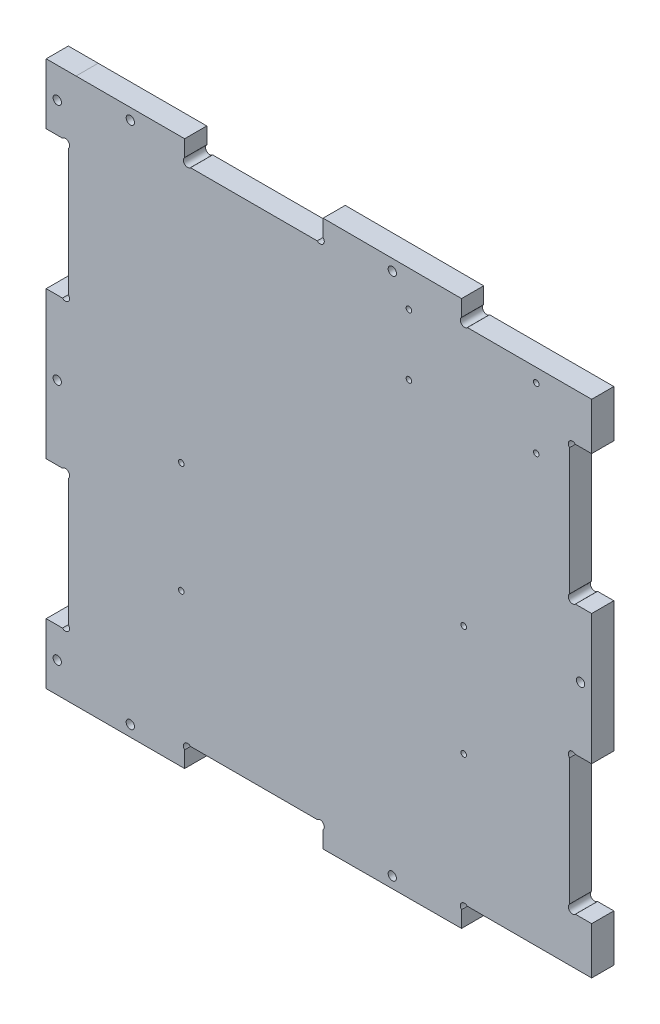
ISO-10303-21;
HEADER;
FILE_DESCRIPTION(('STEP AP214'),'2;1');
FILE_NAME('part.step','',(''),(''),'','','');
FILE_SCHEMA(('AUTOMOTIVE_DESIGN { 1 0 10303 214 1 1 1 1 }'));
ENDSEC;
DATA;
#1=APPLICATION_CONTEXT('core data for automotive mechanical design processes');
#2=APPLICATION_PROTOCOL_DEFINITION('international standard','automotive_design',2000,#1);
#3=PRODUCT_CONTEXT('',#1,'mechanical');
#4=PRODUCT('Part','Part','',(#3));
#5=PRODUCT_RELATED_PRODUCT_CATEGORY('part','',(#4));
#6=PRODUCT_DEFINITION_FORMATION('','',#4);
#7=PRODUCT_DEFINITION_CONTEXT('part definition',#1,'design');
#8=PRODUCT_DEFINITION('design','',#6,#7);
#9=PRODUCT_DEFINITION_SHAPE('','',#8);
#10=(LENGTH_UNIT() NAMED_UNIT(*) SI_UNIT(.MILLI.,.METRE.));
#11=(NAMED_UNIT(*) PLANE_ANGLE_UNIT() SI_UNIT($,.RADIAN.));
#12=(NAMED_UNIT(*) SI_UNIT($,.STERADIAN.) SOLID_ANGLE_UNIT());
#13=UNCERTAINTY_MEASURE_WITH_UNIT(LENGTH_MEASURE(1.E-05),#10,'distance_accuracy_value','');
#14=(GEOMETRIC_REPRESENTATION_CONTEXT(3) GLOBAL_UNCERTAINTY_ASSIGNED_CONTEXT((#13)) GLOBAL_UNIT_ASSIGNED_CONTEXT((#10,
#11,#12)) REPRESENTATION_CONTEXT('',''));
#15=CARTESIAN_POINT('',(0.,0.,0.));
#16=DIRECTION('',(0.,0.,1.));
#17=DIRECTION('',(1.,0.,0.));
#18=AXIS2_PLACEMENT_3D('',#15,#16,#17);
#19=CARTESIAN_POINT('',(149.492806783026,-49.0068265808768,8.));
#20=DIRECTION('',(0.,0.,1.));
#21=DIRECTION('',(1.,0.,0.));
#22=AXIS2_PLACEMENT_3D('',#19,#20,#21);
#23=PLANE('',#22);
#24=CARTESIAN_POINT('',(84.4321468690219,-168.146403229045,8.));
#25=DIRECTION('',(0.,0.,1.));
#26=DIRECTION('',(1.,0.,0.));
#27=AXIS2_PLACEMENT_3D('',#24,#25,#26);
#28=CIRCLE('',#27,1.5);
#29=CARTESIAN_POINT('',(85.9321468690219,-168.146403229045,8.));
#30=VERTEX_POINT('',#29);
#31=EDGE_CURVE('E1370',#30,#30,#28,.T.);
#32=ORIENTED_EDGE('',*,*,#31,.F.);
#33=EDGE_LOOP('',(#32));
#34=FACE_BOUND('',#33,.T.);
#35=CARTESIAN_POINT('',(-36.5678199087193,-161.120902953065,8.));
#36=DIRECTION('',(0.,0.,1.));
#37=DIRECTION('',(1.,0.,0.));
#38=AXIS2_PLACEMENT_3D('',#35,#36,#37);
#39=CIRCLE('',#38,1.5);
#40=CARTESIAN_POINT('',(-35.0678199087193,-161.120902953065,8.));
#41=VERTEX_POINT('',#40);
#42=EDGE_CURVE('E1382',#41,#41,#39,.T.);
#43=ORIENTED_EDGE('',*,*,#42,.F.);
#44=EDGE_LOOP('',(#43));
#45=FACE_BOUND('',#44,.T.);
#46=CARTESIAN_POINT('',(110.232146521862,-77.0674866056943,8.));
#47=DIRECTION('',(0.,0.,1.));
#48=DIRECTION('',(1.,0.,0.));
#49=AXIS2_PLACEMENT_3D('',#46,#47,#48);
#50=CIRCLE('',#49,1.00000002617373);
#51=CARTESIAN_POINT('',(111.232146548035,-77.0674866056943,8.));
#52=VERTEX_POINT('',#51);
#53=EDGE_CURVE('E1394',#52,#52,#50,.T.);
#54=ORIENTED_EDGE('',*,*,#53,.F.);
#55=EDGE_LOOP('',(#54));
#56=FACE_BOUND('',#55,.T.);
#57=CARTESIAN_POINT('',(90.4321467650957,-9.96748642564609,8.));
#58=DIRECTION('',(0.,0.,1.));
#59=DIRECTION('',(1.,0.,0.));
#60=AXIS2_PLACEMENT_3D('',#57,#58,#59);
#61=CIRCLE('',#60,0.999999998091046);
#62=CARTESIAN_POINT('',(91.4321467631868,-9.96748642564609,8.));
#63=VERTEX_POINT('',#62);
#64=EDGE_CURVE('E1406',#63,#63,#61,.T.);
#65=ORIENTED_EDGE('',*,*,#64,.F.);
#66=EDGE_LOOP('',(#65));
#67=FACE_BOUND('',#66,.T.);
#68=CARTESIAN_POINT('',(110.232146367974,-117.067486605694,8.));
#69=DIRECTION('',(0.,0.,1.));
#70=DIRECTION('',(1.,0.,0.));
#71=AXIS2_PLACEMENT_3D('',#68,#69,#70);
#72=CIRCLE('',#71,0.999999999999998);
#73=CARTESIAN_POINT('',(111.232146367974,-117.067486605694,8.));
#74=VERTEX_POINT('',#73);
#75=EDGE_CURVE('E1418',#74,#74,#72,.T.);
#76=ORIENTED_EDGE('',*,*,#75,.F.);
#77=EDGE_LOOP('',(#76));
#78=FACE_BOUND('',#77,.T.);
#79=CARTESIAN_POINT('',(8.23214652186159,-77.0674862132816,8.));
#80=DIRECTION('',(0.,0.,1.));
#81=DIRECTION('',(1.,0.,0.));
#82=AXIS2_PLACEMENT_3D('',#79,#80,#81);
#83=CIRCLE('',#82,1.);
#84=CARTESIAN_POINT('',(9.2321465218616,-77.0674862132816,8.));
#85=VERTEX_POINT('',#84);
#86=EDGE_CURVE('E1430',#85,#85,#83,.T.);
#87=ORIENTED_EDGE('',*,*,#86,.F.);
#88=EDGE_LOOP('',(#87));
#89=FACE_BOUND('',#88,.T.);
#90=CARTESIAN_POINT('',(136.432146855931,12.0325133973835,8.));
#91=DIRECTION('',(0.,0.,1.));
#92=DIRECTION('',(1.,0.,0.));
#93=AXIS2_PLACEMENT_3D('',#90,#91,#92);
#94=CIRCLE('',#93,0.999999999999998);
#95=CARTESIAN_POINT('',(137.432146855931,12.0325133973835,8.));
#96=VERTEX_POINT('',#95);
#97=EDGE_CURVE('E1442',#96,#96,#94,.T.);
#98=ORIENTED_EDGE('',*,*,#97,.F.);
#99=EDGE_LOOP('',(#98));
#100=FACE_BOUND('',#99,.T.);
#101=CARTESIAN_POINT('',(84.4321468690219,21.0114296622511,8.));
#102=DIRECTION('',(0.,0.,1.));
#103=DIRECTION('',(1.,0.,0.));
#104=AXIS2_PLACEMENT_3D('',#101,#102,#103);
#105=CIRCLE('',#104,1.5);
#106=CARTESIAN_POINT('',(85.9321468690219,21.0114296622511,8.));
#107=VERTEX_POINT('',#106);
#108=EDGE_CURVE('E371',#107,#107,#105,.T.);
#109=ORIENTED_EDGE('',*,*,#108,.F.);
#110=EDGE_LOOP('',(#109));
#111=FACE_BOUND('',#110,.T.);
#112=DIRECTION('',(-3.8471814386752E-09,1.,0.));
#113=VECTOR('',#112,1.);
#114=CARTESIAN_POINT('',(156.432146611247,-97.06748678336,8.));
#115=LINE('',#114,#113);
#116=CARTESIAN_POINT('',(156.432146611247,-97.06748678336,8.));
#117=VERTEX_POINT('',#116);
#118=CARTESIAN_POINT('',(156.432146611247,-50.0674867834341,8.));
#119=VERTEX_POINT('',#118);
#120=EDGE_CURVE('E211',#117,#119,#115,.T.);
#121=ORIENTED_EDGE('',*,*,#120,.T.);
#122=DIRECTION('',(-1.,0.,0.));
#123=VECTOR('',#122,1.);
#124=CARTESIAN_POINT('',(150.553466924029,-50.0674867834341,8.));
#125=LINE('',#124,#123);
#126=CARTESIAN_POINT('',(150.553466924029,-50.0674867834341,8.));
#127=VERTEX_POINT('',#126);
#128=EDGE_CURVE('E711',#119,#127,#125,.T.);
#129=ORIENTED_EDGE('',*,*,#128,.T.);
#130=CARTESIAN_POINT('',(149.492806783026,-49.0068265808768,8.));
#131=DIRECTION('',(0.,0.,-1.));
#132=DIRECTION('',(1.,0.,0.));
#133=AXIS2_PLACEMENT_3D('',#130,#131,#132);
#134=CIRCLE('',#133,1.50000000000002);
#135=CARTESIAN_POINT('',(148.432146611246,-47.9461664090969,8.));
#136=VERTEX_POINT('',#135);
#137=EDGE_CURVE('E598',#127,#136,#134,.T.);
#138=ORIENTED_EDGE('',*,*,#137,.T.);
#139=DIRECTION('',(0.,1.,0.));
#140=VECTOR('',#139,1.);
#141=CARTESIAN_POINT('',(148.432146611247,-2.18880690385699,8.));
#142=LINE('',#141,#140);
#143=CARTESIAN_POINT('',(148.432146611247,-2.18880690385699,8.));
#144=VERTEX_POINT('',#143);
#145=EDGE_CURVE('E617',#136,#144,#142,.T.);
#146=ORIENTED_EDGE('',*,*,#145,.T.);
#147=CARTESIAN_POINT('',(149.492806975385,-1.12814692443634,8.));
#148=DIRECTION('',(0.,0.,-1.));
#149=DIRECTION('',(1.,0.,0.));
#150=AXIS2_PLACEMENT_3D('',#147,#148,#149);
#151=CIRCLE('',#150,1.49999999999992);
#152=CARTESIAN_POINT('',(150.553467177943,-0.0674867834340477,8.));
#153=VERTEX_POINT('',#152);
#154=EDGE_CURVE('E614',#144,#153,#151,.T.);
#155=ORIENTED_EDGE('',*,*,#154,.T.);
#156=DIRECTION('',(1.,0.,0.));
#157=VECTOR('',#156,1.);
#158=CARTESIAN_POINT('',(156.432146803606,-0.0674867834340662,8.));
#159=LINE('',#158,#157);
#160=CARTESIAN_POINT('',(156.432146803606,-0.0674867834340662,8.));
#161=VERTEX_POINT('',#160);
#162=EDGE_CURVE('E616',#153,#161,#159,.T.);
#163=ORIENTED_EDGE('',*,*,#162,.T.);
#164=DIRECTION('',(0.,1.,0.));
#165=VECTOR('',#164,1.);
#166=CARTESIAN_POINT('',(156.432146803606,16.9325133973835,8.));
#167=LINE('',#166,#165);
#168=CARTESIAN_POINT('',(156.432146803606,16.9325133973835,8.));
#169=VERTEX_POINT('',#168);
#170=EDGE_CURVE('E619',#161,#169,#167,.T.);
#171=ORIENTED_EDGE('',*,*,#170,.T.);
#172=DIRECTION('',(-1.,0.,0.));
#173=VECTOR('',#172,1.);
#174=CARTESIAN_POINT('',(156.432146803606,16.9325133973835,8.));
#175=LINE('',#174,#173);
#176=CARTESIAN_POINT('',(111.553466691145,16.9325133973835,8.));
#177=VERTEX_POINT('',#176);
#178=EDGE_CURVE('E625',#169,#177,#175,.T.);
#179=ORIENTED_EDGE('',*,*,#178,.T.);
#180=CARTESIAN_POINT('',(110.492807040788,17.9931740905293,8.));
#181=DIRECTION('',(0.,0.,-1.));
#182=DIRECTION('',(1.,0.,0.));
#183=AXIS2_PLACEMENT_3D('',#180,#181,#182);
#184=CIRCLE('',#183,1.49999999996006);
#185=CARTESIAN_POINT('',(109.432146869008,19.0538342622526,8.));
#186=VERTEX_POINT('',#185);
#187=EDGE_CURVE('E627',#177,#186,#184,.T.);
#188=ORIENTED_EDGE('',*,*,#187,.T.);
#189=DIRECTION('',(0.,1.,0.));
#190=VECTOR('',#189,1.);
#191=CARTESIAN_POINT('',(109.432146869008,19.0538342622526,8.));
#192=LINE('',#191,#190);
#193=CARTESIAN_POINT('',(109.432146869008,24.9382847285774,8.));
#194=VERTEX_POINT('',#193);
#195=EDGE_CURVE('E629',#186,#194,#192,.T.);
#196=ORIENTED_EDGE('',*,*,#195,.T.);
#197=DIRECTION('',(-0.999995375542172,0.00304119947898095,0.));
#198=VECTOR('',#197,1.);
#199=CARTESIAN_POINT('',(59.4321468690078,25.0903454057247,8.));
#200=LINE('',#199,#198);
#201=CARTESIAN_POINT('',(59.4321468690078,25.0903454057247,8.));
#202=VERTEX_POINT('',#201);
#203=EDGE_CURVE('E631',#194,#202,#200,.T.);
#204=ORIENTED_EDGE('',*,*,#203,.T.);
#205=DIRECTION('',(0.,-1.,0.));
#206=VECTOR('',#205,1.);
#207=CARTESIAN_POINT('',(59.4321468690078,25.0903454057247,8.));
#208=LINE('',#207,#206);
#209=CARTESIAN_POINT('',(59.4321468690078,19.0538342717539,8.));
#210=VERTEX_POINT('',#209);
#211=EDGE_CURVE('E633',#202,#210,#208,.T.);
#212=ORIENTED_EDGE('',*,*,#211,.T.);
#213=CARTESIAN_POINT('',(58.3714864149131,17.9931741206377,8.));
#214=DIRECTION('',(0.,0.,-1.));
#215=DIRECTION('',(1.,0.,0.));
#216=AXIS2_PLACEMENT_3D('',#213,#214,#215);
#217=CIRCLE('',#216,1.50000018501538);
#218=CARTESIAN_POINT('',(57.3108259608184,16.9325139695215,8.));
#219=VERTEX_POINT('',#218);
#220=EDGE_CURVE('E635',#210,#219,#217,.T.);
#221=ORIENTED_EDGE('',*,*,#220,.T.);
#222=DIRECTION('',(-1.,0.,0.));
#223=VECTOR('',#222,1.);
#224=CARTESIAN_POINT('',(57.3108259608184,16.9325139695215,8.));
#225=LINE('',#224,#223);
#226=CARTESIAN_POINT('',(11.5534666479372,16.9325139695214,8.));
#227=VERTEX_POINT('',#226);
#228=EDGE_CURVE('E637',#219,#227,#225,.T.);
#229=ORIENTED_EDGE('',*,*,#228,.T.);
#230=CARTESIAN_POINT('',(10.4928064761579,17.9931741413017,8.));
#231=DIRECTION('',(0.,0.,-1.));
#232=DIRECTION('',(1.,0.,0.));
#233=AXIS2_PLACEMENT_3D('',#230,#231,#232);
#234=CIRCLE('',#233,1.49999999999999);
#235=CARTESIAN_POINT('',(9.43214630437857,19.053834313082,8.));
#236=VERTEX_POINT('',#235);
#237=EDGE_CURVE('E639',#227,#236,#234,.T.);
#238=ORIENTED_EDGE('',*,*,#237,.T.);
#239=DIRECTION('',(0.,1.,0.));
#240=VECTOR('',#239,1.);
#241=CARTESIAN_POINT('',(9.43214630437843,24.9325139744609,8.));
#242=LINE('',#241,#240);
#243=CARTESIAN_POINT('',(9.43214630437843,24.9325139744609,8.));
#244=VERTEX_POINT('',#243);
#245=EDGE_CURVE('E641',#236,#244,#242,.T.);
#246=ORIENTED_EDGE('',*,*,#245,.T.);
#247=DIRECTION('',(-1.,0.,0.));
#248=VECTOR('',#247,1.);
#249=CARTESIAN_POINT('',(9.43214630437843,24.9325139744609,8.));
#250=LINE('',#249,#248);
#251=CARTESIAN_POINT('',(-29.7961849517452,24.9325139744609,8.));
#252=VERTEX_POINT('',#251);
#253=EDGE_CURVE('E643',#244,#252,#250,.T.);
#254=ORIENTED_EDGE('',*,*,#253,.T.);
#255=DIRECTION('',(-0.999999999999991,-1.33409353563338E-07,0.));
#256=VECTOR('',#255,1.);
#257=CARTESIAN_POINT('',(-29.7961849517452,24.9325139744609,8.));
#258=LINE('',#257,#256);
#259=CARTESIAN_POINT('',(-40.5678536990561,24.9325125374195,8.));
#260=VERTEX_POINT('',#259);
#261=EDGE_CURVE('E645',#252,#260,#258,.T.);
#262=ORIENTED_EDGE('',*,*,#261,.T.);
#263=DIRECTION('',(0.,-1.,0.));
#264=VECTOR('',#263,1.);
#265=CARTESIAN_POINT('',(-40.5678536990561,24.9325125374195,8.));
#266=LINE('',#265,#264);
#267=CARTESIAN_POINT('',(-40.5678536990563,3.03941380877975,8.));
#268=VERTEX_POINT('',#267);
#269=EDGE_CURVE('E647',#260,#268,#266,.T.);
#270=ORIENTED_EDGE('',*,*,#269,.T.);
#271=DIRECTION('',(1.,0.,0.));
#272=VECTOR('',#271,1.);
#273=CARTESIAN_POINT('',(-40.5678536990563,3.03941380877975,8.));
#274=LINE('',#273,#272);
#275=CARTESIAN_POINT('',(-34.6891740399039,3.03941380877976,8.));
#276=VERTEX_POINT('',#275);
#277=EDGE_CURVE('E649',#268,#276,#274,.T.);
#278=ORIENTED_EDGE('',*,*,#277,.T.);
#279=CARTESIAN_POINT('',(-33.628513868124,1.97861848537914,8.));
#280=DIRECTION('',(0.,0.,-1.));
#281=DIRECTION('',(1.,0.,0.));
#282=AXIS2_PLACEMENT_3D('',#279,#280,#281);
#283=CIRCLE('',#282,1.5000955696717);
#284=CARTESIAN_POINT('',(-32.5678536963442,0.917823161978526,8.));
#285=VERTEX_POINT('',#284);
#286=EDGE_CURVE('E651',#276,#285,#283,.T.);
#287=ORIENTED_EDGE('',*,*,#286,.T.);
#288=DIRECTION('',(0.,-1.,0.));
#289=VECTOR('',#288,1.);
#290=CARTESIAN_POINT('',(-32.5678536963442,0.917823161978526,8.));
#291=LINE('',#290,#289);
#292=CARTESIAN_POINT('',(-32.5678536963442,-44.8393497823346,8.));
#293=VERTEX_POINT('',#292);
#294=EDGE_CURVE('E653',#285,#293,#291,.T.);
#295=ORIENTED_EDGE('',*,*,#294,.T.);
#296=CARTESIAN_POINT('',(-33.628513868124,-45.9000099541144,8.));
#297=DIRECTION('',(0.,0.,-1.));
#298=DIRECTION('',(1.,0.,0.));
#299=AXIS2_PLACEMENT_3D('',#296,#297,#298);
#300=CIRCLE('',#299,1.5);
#301=CARTESIAN_POINT('',(-34.6891740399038,-46.9606701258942,8.));
#302=VERTEX_POINT('',#301);
#303=EDGE_CURVE('E655',#293,#302,#300,.T.);
#304=ORIENTED_EDGE('',*,*,#303,.T.);
#305=DIRECTION('',(-1.,0.,0.));
#306=VECTOR('',#305,1.);
#307=CARTESIAN_POINT('',(-34.6891740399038,-46.9606701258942,8.));
#308=LINE('',#307,#306);
#309=CARTESIAN_POINT('',(-40.5678537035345,-46.9606701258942,8.));
#310=VERTEX_POINT('',#309);
#311=EDGE_CURVE('E657',#302,#310,#308,.T.);
#312=ORIENTED_EDGE('',*,*,#311,.T.);
#313=DIRECTION('',(0.,-1.,0.));
#314=VECTOR('',#313,1.);
#315=CARTESIAN_POINT('',(-40.5678537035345,-46.9606701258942,8.));
#316=LINE('',#315,#314);
#317=CARTESIAN_POINT('',(-40.5678537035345,-100.1743034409,8.));
#318=VERTEX_POINT('',#317);
#319=EDGE_CURVE('E659',#310,#318,#316,.T.);
#320=ORIENTED_EDGE('',*,*,#319,.T.);
#321=DIRECTION('',(1.,0.,0.));
#322=VECTOR('',#321,1.);
#323=CARTESIAN_POINT('',(-34.6891740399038,-100.1743034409,8.));
#324=LINE('',#323,#322);
#325=CARTESIAN_POINT('',(-34.6891740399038,-100.1743034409,8.));
#326=VERTEX_POINT('',#325);
#327=EDGE_CURVE('E661',#318,#326,#324,.T.);
#328=ORIENTED_EDGE('',*,*,#327,.T.);
#329=CARTESIAN_POINT('',(-33.628513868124,-101.23496361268,8.));
#330=DIRECTION('',(0.,0.,-1.));
#331=DIRECTION('',(-1.,0.,0.));
#332=AXIS2_PLACEMENT_3D('',#329,#330,#331);
#333=CIRCLE('',#332,1.5);
#334=CARTESIAN_POINT('',(-32.5678536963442,-102.29562378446,8.));
#335=VERTEX_POINT('',#334);
#336=EDGE_CURVE('E663',#326,#335,#333,.T.);
#337=ORIENTED_EDGE('',*,*,#336,.T.);
#338=DIRECTION('',(0.,-1.,0.));
#339=VECTOR('',#338,1.);
#340=CARTESIAN_POINT('',(-32.5678536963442,-148.052796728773,8.));
#341=LINE('',#340,#339);
#342=CARTESIAN_POINT('',(-32.5678536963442,-148.052796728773,8.));
#343=VERTEX_POINT('',#342);
#344=EDGE_CURVE('E665',#335,#343,#341,.T.);
#345=ORIENTED_EDGE('',*,*,#344,.T.);
#346=CARTESIAN_POINT('',(-33.628513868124,-149.113592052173,8.));
#347=DIRECTION('',(0.,0.,-1.));
#348=DIRECTION('',(-1.,0.,0.));
#349=AXIS2_PLACEMENT_3D('',#346,#347,#348);
#350=CIRCLE('',#349,1.5000955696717);
#351=CARTESIAN_POINT('',(-34.6891740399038,-150.174387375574,8.));
#352=VERTEX_POINT('',#351);
#353=EDGE_CURVE('E667',#343,#352,#350,.T.);
#354=ORIENTED_EDGE('',*,*,#353,.T.);
#355=DIRECTION('',(-1.,0.,0.));
#356=VECTOR('',#355,1.);
#357=CARTESIAN_POINT('',(-40.5678536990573,-150.174387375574,8.));
#358=LINE('',#357,#356);
#359=CARTESIAN_POINT('',(-40.5678536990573,-150.174387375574,8.));
#360=VERTEX_POINT('',#359);
#361=EDGE_CURVE('E669',#352,#360,#358,.T.);
#362=ORIENTED_EDGE('',*,*,#361,.T.);
#363=DIRECTION('',(0.,-1.,0.));
#364=VECTOR('',#363,1.);
#365=CARTESIAN_POINT('',(-40.5678536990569,-172.067486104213,8.));
#366=LINE('',#365,#364);
#367=CARTESIAN_POINT('',(-40.5678536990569,-172.067486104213,8.));
#368=VERTEX_POINT('',#367);
#369=EDGE_CURVE('E671',#360,#368,#366,.T.);
#370=ORIENTED_EDGE('',*,*,#369,.T.);
#371=DIRECTION('',(0.999999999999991,-1.33409375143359E-07,0.));
#372=VECTOR('',#371,1.);
#373=CARTESIAN_POINT('',(-29.7961849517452,-172.067487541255,8.));
#374=LINE('',#373,#372);
#375=CARTESIAN_POINT('',(-29.7961849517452,-172.067487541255,8.));
#376=VERTEX_POINT('',#375);
#377=EDGE_CURVE('E673',#368,#376,#374,.T.);
#378=ORIENTED_EDGE('',*,*,#377,.T.);
#379=DIRECTION('',(1.,0.,0.));
#380=VECTOR('',#379,1.);
#381=CARTESIAN_POINT('',(9.43214630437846,-172.067487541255,8.));
#382=LINE('',#381,#380);
#383=CARTESIAN_POINT('',(9.43214630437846,-172.067487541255,8.));
#384=VERTEX_POINT('',#383);
#385=EDGE_CURVE('E675',#376,#384,#382,.T.);
#386=ORIENTED_EDGE('',*,*,#385,.T.);
#387=DIRECTION('',(0.,1.,0.));
#388=VECTOR('',#387,1.);
#389=CARTESIAN_POINT('',(9.43214630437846,-172.067487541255,8.));
#390=LINE('',#389,#388);
#391=CARTESIAN_POINT('',(9.43214630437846,-166.188807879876,8.));
#392=VERTEX_POINT('',#391);
#393=EDGE_CURVE('E677',#384,#392,#390,.T.);
#394=ORIENTED_EDGE('',*,*,#393,.T.);
#395=CARTESIAN_POINT('',(10.4928064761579,-165.128147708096,8.));
#396=DIRECTION('',(0.,0.,-1.));
#397=DIRECTION('',(-1.,0.,0.));
#398=AXIS2_PLACEMENT_3D('',#395,#396,#397);
#399=CIRCLE('',#398,1.49999999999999);
#400=CARTESIAN_POINT('',(11.5534666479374,-164.067487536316,8.));
#401=VERTEX_POINT('',#400);
#402=EDGE_CURVE('E679',#392,#401,#399,.T.);
#403=ORIENTED_EDGE('',*,*,#402,.T.);
#404=DIRECTION('',(1.,0.,0.));
#405=VECTOR('',#404,1.);
#406=CARTESIAN_POINT('',(57.3108259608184,-164.067487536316,8.));
#407=LINE('',#406,#405);
#408=CARTESIAN_POINT('',(57.3108259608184,-164.067487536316,8.));
#409=VERTEX_POINT('',#408);
#410=EDGE_CURVE('E681',#401,#409,#407,.T.);
#411=ORIENTED_EDGE('',*,*,#410,.T.);
#412=CARTESIAN_POINT('',(58.3714864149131,-165.128147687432,8.));
#413=DIRECTION('',(0.,0.,-1.));
#414=DIRECTION('',(-1.,0.,0.));
#415=AXIS2_PLACEMENT_3D('',#412,#413,#414);
#416=CIRCLE('',#415,1.50000018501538);
#417=CARTESIAN_POINT('',(59.4321468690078,-166.188807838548,8.));
#418=VERTEX_POINT('',#417);
#419=EDGE_CURVE('E683',#409,#418,#416,.T.);
#420=ORIENTED_EDGE('',*,*,#419,.T.);
#421=DIRECTION('',(0.,-1.,0.));
#422=VECTOR('',#421,1.);
#423=CARTESIAN_POINT('',(59.4321468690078,-172.225318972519,8.));
#424=LINE('',#423,#422);
#425=CARTESIAN_POINT('',(59.4321468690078,-172.225318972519,8.));
#426=VERTEX_POINT('',#425);
#427=EDGE_CURVE('E685',#418,#426,#424,.T.);
#428=ORIENTED_EDGE('',*,*,#427,.T.);
#429=DIRECTION('',(0.999995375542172,0.00304119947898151,0.));
#430=VECTOR('',#429,1.);
#431=CARTESIAN_POINT('',(59.4321468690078,-172.225318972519,8.));
#432=LINE('',#431,#430);
#433=CARTESIAN_POINT('',(109.432146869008,-172.073258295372,8.));
#434=VERTEX_POINT('',#433);
#435=EDGE_CURVE('E687',#426,#434,#432,.T.);
#436=ORIENTED_EDGE('',*,*,#435,.T.);
#437=DIRECTION('',(0.,1.,0.));
#438=VECTOR('',#437,1.);
#439=CARTESIAN_POINT('',(109.432146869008,-166.347355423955,8.));
#440=LINE('',#439,#438);
#441=CARTESIAN_POINT('',(109.432146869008,-166.188807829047,8.));
#442=VERTEX_POINT('',#441);
#443=EDGE_CURVE('E689',#434,#442,#440,.T.);
#444=ORIENTED_EDGE('',*,*,#443,.T.);
#445=CARTESIAN_POINT('',(110.492807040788,-165.128147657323,8.));
#446=DIRECTION('',(0.,0.,-1.));
#447=DIRECTION('',(-1.,0.,0.));
#448=AXIS2_PLACEMENT_3D('',#445,#446,#447);
#449=CIRCLE('',#448,1.49999999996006);
#450=CARTESIAN_POINT('',(111.553466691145,-164.067486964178,8.));
#451=VERTEX_POINT('',#450);
#452=EDGE_CURVE('E691',#442,#451,#449,.T.);
#453=ORIENTED_EDGE('',*,*,#452,.T.);
#454=DIRECTION('',(1.,0.,0.));
#455=VECTOR('',#454,1.);
#456=CARTESIAN_POINT('',(156.432146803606,-164.067486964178,8.));
#457=LINE('',#456,#455);
#458=CARTESIAN_POINT('',(156.432146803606,-164.067486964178,8.));
#459=VERTEX_POINT('',#458);
#460=EDGE_CURVE('E693',#451,#459,#457,.T.);
#461=ORIENTED_EDGE('',*,*,#460,.T.);
#462=DIRECTION('',(0.,1.,0.));
#463=VECTOR('',#462,1.);
#464=CARTESIAN_POINT('',(156.432146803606,-164.067486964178,8.));
#465=LINE('',#464,#463);
#466=CARTESIAN_POINT('',(156.432146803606,-147.06748678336,8.));
#467=VERTEX_POINT('',#466);
#468=EDGE_CURVE('E695',#459,#467,#465,.T.);
#469=ORIENTED_EDGE('',*,*,#468,.T.);
#470=DIRECTION('',(-1.,0.,0.));
#471=VECTOR('',#470,1.);
#472=CARTESIAN_POINT('',(156.432146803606,-147.06748678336,8.));
#473=LINE('',#472,#471);
#474=CARTESIAN_POINT('',(150.553467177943,-147.06748678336,8.));
#475=VERTEX_POINT('',#474);
#476=EDGE_CURVE('E697',#467,#475,#473,.T.);
#477=ORIENTED_EDGE('',*,*,#476,.T.);
#478=CARTESIAN_POINT('',(149.492806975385,-146.006826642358,8.));
#479=DIRECTION('',(0.,0.,-1.));
#480=DIRECTION('',(-1.,0.,0.));
#481=AXIS2_PLACEMENT_3D('',#478,#479,#480);
#482=CIRCLE('',#481,1.49999999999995);
#483=CARTESIAN_POINT('',(148.432146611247,-144.946166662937,8.));
#484=VERTEX_POINT('',#483);
#485=EDGE_CURVE('E351',#475,#484,#482,.T.);
#486=ORIENTED_EDGE('',*,*,#485,.T.);
#487=DIRECTION('',(0.,1.,0.));
#488=VECTOR('',#487,1.);
#489=CARTESIAN_POINT('',(148.432146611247,-144.946166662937,8.));
#490=LINE('',#489,#488);
#491=CARTESIAN_POINT('',(148.432146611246,-99.1888071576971,8.));
#492=VERTEX_POINT('',#491);
#493=EDGE_CURVE('E345',#484,#492,#490,.T.);
#494=ORIENTED_EDGE('',*,*,#493,.T.);
#495=CARTESIAN_POINT('',(149.492806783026,-98.1281469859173,8.));
#496=DIRECTION('',(0.,0.,-1.));
#497=DIRECTION('',(-1.,0.,0.));
#498=AXIS2_PLACEMENT_3D('',#495,#496,#497);
#499=CIRCLE('',#498,1.50000000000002);
#500=CARTESIAN_POINT('',(150.553466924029,-97.06748678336,8.));
#501=VERTEX_POINT('',#500);
#502=EDGE_CURVE('E349',#492,#501,#499,.T.);
#503=ORIENTED_EDGE('',*,*,#502,.T.);
#504=DIRECTION('',(1.,0.,0.));
#505=VECTOR('',#504,1.);
#506=CARTESIAN_POINT('',(150.553466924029,-97.06748678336,8.));
#507=LINE('',#506,#505);
#508=EDGE_CURVE('E49',#501,#117,#507,.T.);
#509=ORIENTED_EDGE('',*,*,#508,.T.);
#510=EDGE_LOOP('',(#121,#129,#138,#146,#155,#163,#171,#179,#188,#196,#204,#212,#221,#229,#238,
#246,#254,#262,#270,#278,#287,#295,#304,#312,#320,#328,#337,#345,#354,#362,#370,#378,#386,#394,
#403,#411,#420,#428,#436,#444,#453,#461,#469,#477,#486,#494,#503,#509));
#511=FACE_BOUND('',#510,.T.);
#512=CARTESIAN_POINT('',(-10.1820193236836,20.9325139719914,8.));
#513=DIRECTION('',(0.,0.,1.));
#514=DIRECTION('',(1.,0.,0.));
#515=AXIS2_PLACEMENT_3D('',#512,#513,#514);
#516=CIRCLE('',#515,1.50000000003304);
#517=CARTESIAN_POINT('',(-8.68201932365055,20.9325139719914,8.));
#518=VERTEX_POINT('',#517);
#519=EDGE_CURVE('E1448',#518,#518,#516,.T.);
#520=ORIENTED_EDGE('',*,*,#519,.F.);
#521=EDGE_LOOP('',(#520));
#522=FACE_BOUND('',#521,.T.);
#523=CARTESIAN_POINT('',(-36.5678199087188,13.9859293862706,8.));
#524=DIRECTION('',(0.,0.,1.));
#525=DIRECTION('',(1.,0.,0.));
#526=AXIS2_PLACEMENT_3D('',#523,#524,#525);
#527=CIRCLE('',#526,1.5);
#528=CARTESIAN_POINT('',(-35.0678199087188,13.9859293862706,8.));
#529=VERTEX_POINT('',#528);
#530=EDGE_CURVE('E1436',#529,#529,#527,.T.);
#531=ORIENTED_EDGE('',*,*,#530,.F.);
#532=EDGE_LOOP('',(#531));
#533=FACE_BOUND('',#532,.T.);
#534=CARTESIAN_POINT('',(8.23214636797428,-117.067486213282,8.));
#535=DIRECTION('',(0.,0.,1.));
#536=DIRECTION('',(1.,0.,0.));
#537=AXIS2_PLACEMENT_3D('',#534,#535,#536);
#538=CIRCLE('',#537,1.);
#539=CARTESIAN_POINT('',(9.23214636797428,-117.067486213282,8.));
#540=VERTEX_POINT('',#539);
#541=EDGE_CURVE('E1424',#540,#540,#538,.T.);
#542=ORIENTED_EDGE('',*,*,#541,.F.);
#543=EDGE_LOOP('',(#542));
#544=FACE_BOUND('',#543,.T.);
#545=CARTESIAN_POINT('',(90.4321468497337,12.0325135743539,8.));
#546=DIRECTION('',(0.,0.,1.));
#547=DIRECTION('',(1.,0.,0.));
#548=AXIS2_PLACEMENT_3D('',#545,#546,#547);
#549=CIRCLE('',#548,0.999999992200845);
#550=CARTESIAN_POINT('',(91.4321468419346,12.0325135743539,8.));
#551=VERTEX_POINT('',#550);
#552=EDGE_CURVE('E1412',#551,#551,#549,.T.);
#553=ORIENTED_EDGE('',*,*,#552,.F.);
#554=EDGE_LOOP('',(#553));
#555=FACE_BOUND('',#554,.T.);
#556=CARTESIAN_POINT('',(136.432146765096,-9.96748660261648,8.));
#557=DIRECTION('',(0.,0.,1.));
#558=DIRECTION('',(1.,0.,0.));
#559=AXIS2_PLACEMENT_3D('',#556,#557,#558);
#560=CIRCLE('',#559,1.00000000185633);
#561=CARTESIAN_POINT('',(137.432146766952,-9.96748660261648,8.));
#562=VERTEX_POINT('',#561);
#563=EDGE_CURVE('E1400',#562,#562,#560,.T.);
#564=ORIENTED_EDGE('',*,*,#563,.F.);
#565=EDGE_LOOP('',(#564));
#566=FACE_BOUND('',#565,.T.);
#567=CARTESIAN_POINT('',(-36.5678536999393,-73.5674867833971,8.));
#568=DIRECTION('',(0.,0.,1.));
#569=DIRECTION('',(1.,0.,0.));
#570=AXIS2_PLACEMENT_3D('',#567,#568,#569);
#571=CIRCLE('',#570,1.49999999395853);
#572=CARTESIAN_POINT('',(-35.0678537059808,-73.5674867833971,8.));
#573=VERTEX_POINT('',#572);
#574=EDGE_CURVE('E1388',#573,#573,#571,.T.);
#575=ORIENTED_EDGE('',*,*,#574,.F.);
#576=EDGE_LOOP('',(#575));
#577=FACE_BOUND('',#576,.T.);
#578=CARTESIAN_POINT('',(-10.1820193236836,-168.067487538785,8.));
#579=DIRECTION('',(0.,0.,1.));
#580=DIRECTION('',(1.,0.,0.));
#581=AXIS2_PLACEMENT_3D('',#578,#579,#580);
#582=CIRCLE('',#581,1.5);
#583=CARTESIAN_POINT('',(-8.68201932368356,-168.067487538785,8.));
#584=VERTEX_POINT('',#583);
#585=EDGE_CURVE('E1376',#584,#584,#582,.T.);
#586=ORIENTED_EDGE('',*,*,#585,.F.);
#587=EDGE_LOOP('',(#586));
#588=FACE_BOUND('',#587,.T.);
#589=CARTESIAN_POINT('',(152.432146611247,-73.5674867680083,8.));
#590=DIRECTION('',(0.,0.,1.));
#591=DIRECTION('',(1.,0.,0.));
#592=AXIS2_PLACEMENT_3D('',#589,#590,#591);
#593=CIRCLE('',#592,1.5);
#594=CARTESIAN_POINT('',(153.932146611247,-73.5674867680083,8.));
#595=VERTEX_POINT('',#594);
#596=EDGE_CURVE('E1361',#595,#595,#593,.T.);
#597=ORIENTED_EDGE('',*,*,#596,.F.);
#598=EDGE_LOOP('',(#597));
#599=FACE_BOUND('',#598,.T.);
#600=ADVANCED_FACE('F32',(#34,#45,#56,#67,#78,#89,#100,#111,#511,#522,#533,#544,#555,#566,#577,
#588,#599),#23,.T.);
#601=CARTESIAN_POINT('',(149.492806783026,-49.0068265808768,0.));
#602=DIRECTION('',(0.,0.,1.));
#603=DIRECTION('',(1.,0.,0.));
#604=AXIS2_PLACEMENT_3D('',#601,#602,#603);
#605=PLANE('',#604);
#606=CARTESIAN_POINT('',(84.4321468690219,-168.146403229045,0.));
#607=DIRECTION('',(0.,0.,1.));
#608=DIRECTION('',(1.,0.,0.));
#609=AXIS2_PLACEMENT_3D('',#606,#607,#608);
#610=CIRCLE('',#609,1.5);
#611=CARTESIAN_POINT('',(85.9321468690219,-168.146403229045,0.));
#612=VERTEX_POINT('',#611);
#613=EDGE_CURVE('E1367',#612,#612,#610,.T.);
#614=ORIENTED_EDGE('',*,*,#613,.T.);
#615=EDGE_LOOP('',(#614));
#616=FACE_BOUND('',#615,.T.);
#617=CARTESIAN_POINT('',(-36.5678199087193,-161.120902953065,0.));
#618=DIRECTION('',(0.,0.,1.));
#619=DIRECTION('',(1.,0.,0.));
#620=AXIS2_PLACEMENT_3D('',#617,#618,#619);
#621=CIRCLE('',#620,1.5);
#622=CARTESIAN_POINT('',(-35.0678199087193,-161.120902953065,0.));
#623=VERTEX_POINT('',#622);
#624=EDGE_CURVE('E1379',#623,#623,#621,.T.);
#625=ORIENTED_EDGE('',*,*,#624,.T.);
#626=EDGE_LOOP('',(#625));
#627=FACE_BOUND('',#626,.T.);
#628=CARTESIAN_POINT('',(110.232146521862,-77.0674866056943,0.));
#629=DIRECTION('',(0.,0.,1.));
#630=DIRECTION('',(1.,0.,0.));
#631=AXIS2_PLACEMENT_3D('',#628,#629,#630);
#632=CIRCLE('',#631,1.00000002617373);
#633=CARTESIAN_POINT('',(111.232146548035,-77.0674866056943,0.));
#634=VERTEX_POINT('',#633);
#635=EDGE_CURVE('E1391',#634,#634,#632,.T.);
#636=ORIENTED_EDGE('',*,*,#635,.T.);
#637=EDGE_LOOP('',(#636));
#638=FACE_BOUND('',#637,.T.);
#639=CARTESIAN_POINT('',(90.4321467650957,-9.96748642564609,0.));
#640=DIRECTION('',(0.,0.,1.));
#641=DIRECTION('',(1.,0.,0.));
#642=AXIS2_PLACEMENT_3D('',#639,#640,#641);
#643=CIRCLE('',#642,0.999999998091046);
#644=CARTESIAN_POINT('',(91.4321467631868,-9.96748642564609,0.));
#645=VERTEX_POINT('',#644);
#646=EDGE_CURVE('E1403',#645,#645,#643,.T.);
#647=ORIENTED_EDGE('',*,*,#646,.T.);
#648=EDGE_LOOP('',(#647));
#649=FACE_BOUND('',#648,.T.);
#650=CARTESIAN_POINT('',(110.232146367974,-117.067486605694,0.));
#651=DIRECTION('',(0.,0.,1.));
#652=DIRECTION('',(1.,0.,0.));
#653=AXIS2_PLACEMENT_3D('',#650,#651,#652);
#654=CIRCLE('',#653,0.999999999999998);
#655=CARTESIAN_POINT('',(111.232146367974,-117.067486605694,0.));
#656=VERTEX_POINT('',#655);
#657=EDGE_CURVE('E1415',#656,#656,#654,.T.);
#658=ORIENTED_EDGE('',*,*,#657,.T.);
#659=EDGE_LOOP('',(#658));
#660=FACE_BOUND('',#659,.T.);
#661=CARTESIAN_POINT('',(8.23214652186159,-77.0674862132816,0.));
#662=DIRECTION('',(0.,0.,1.));
#663=DIRECTION('',(1.,0.,0.));
#664=AXIS2_PLACEMENT_3D('',#661,#662,#663);
#665=CIRCLE('',#664,1.);
#666=CARTESIAN_POINT('',(9.2321465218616,-77.0674862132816,0.));
#667=VERTEX_POINT('',#666);
#668=EDGE_CURVE('E1427',#667,#667,#665,.T.);
#669=ORIENTED_EDGE('',*,*,#668,.T.);
#670=EDGE_LOOP('',(#669));
#671=FACE_BOUND('',#670,.T.);
#672=CARTESIAN_POINT('',(136.432146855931,12.0325133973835,0.));
#673=DIRECTION('',(0.,0.,1.));
#674=DIRECTION('',(1.,0.,0.));
#675=AXIS2_PLACEMENT_3D('',#672,#673,#674);
#676=CIRCLE('',#675,0.999999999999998);
#677=CARTESIAN_POINT('',(137.432146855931,12.0325133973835,0.));
#678=VERTEX_POINT('',#677);
#679=EDGE_CURVE('E1439',#678,#678,#676,.T.);
#680=ORIENTED_EDGE('',*,*,#679,.T.);
#681=EDGE_LOOP('',(#680));
#682=FACE_BOUND('',#681,.T.);
#683=CARTESIAN_POINT('',(84.4321468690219,21.0114296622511,0.));
#684=DIRECTION('',(0.,0.,1.));
#685=DIRECTION('',(1.,0.,0.));
#686=AXIS2_PLACEMENT_3D('',#683,#684,#685);
#687=CIRCLE('',#686,1.5);
#688=CARTESIAN_POINT('',(85.9321468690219,21.0114296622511,0.));
#689=VERTEX_POINT('',#688);
#690=EDGE_CURVE('E715',#689,#689,#687,.T.);
#691=ORIENTED_EDGE('',*,*,#690,.T.);
#692=EDGE_LOOP('',(#691));
#693=FACE_BOUND('',#692,.T.);
#694=DIRECTION('',(3.8471814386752E-09,1.,0.));
#695=VECTOR('',#694,1.);
#696=CARTESIAN_POINT('',(156.432146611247,-50.0674867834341,0.));
#697=LINE('',#696,#695);
#698=CARTESIAN_POINT('',(156.432146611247,-97.06748678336,0.));
#699=VERTEX_POINT('',#698);
#700=CARTESIAN_POINT('',(156.432146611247,-50.0674867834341,0.));
#701=VERTEX_POINT('',#700);
#702=EDGE_CURVE('E205',#699,#701,#697,.T.);
#703=ORIENTED_EDGE('',*,*,#702,.F.);
#704=DIRECTION('',(1.,0.,0.));
#705=VECTOR('',#704,1.);
#706=CARTESIAN_POINT('',(150.553466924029,-97.06748678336,0.));
#707=LINE('',#706,#705);
#708=CARTESIAN_POINT('',(150.553466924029,-97.06748678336,0.));
#709=VERTEX_POINT('',#708);
#710=EDGE_CURVE('E463',#709,#699,#707,.T.);
#711=ORIENTED_EDGE('',*,*,#710,.F.);
#712=CARTESIAN_POINT('',(149.492806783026,-98.1281469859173,0.));
#713=DIRECTION('',(0.,0.,-1.));
#714=DIRECTION('',(-1.,0.,0.));
#715=AXIS2_PLACEMENT_3D('',#712,#713,#714);
#716=CIRCLE('',#715,1.50000000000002);
#717=CARTESIAN_POINT('',(148.432146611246,-99.1888071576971,0.));
#718=VERTEX_POINT('',#717);
#719=EDGE_CURVE('E198',#718,#709,#716,.T.);
#720=ORIENTED_EDGE('',*,*,#719,.F.);
#721=DIRECTION('',(0.,1.,0.));
#722=VECTOR('',#721,1.);
#723=CARTESIAN_POINT('',(148.432146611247,-144.946166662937,0.));
#724=LINE('',#723,#722);
#725=CARTESIAN_POINT('',(148.432146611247,-144.946166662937,0.));
#726=VERTEX_POINT('',#725);
#727=EDGE_CURVE('E359',#726,#718,#724,.T.);
#728=ORIENTED_EDGE('',*,*,#727,.F.);
#729=CARTESIAN_POINT('',(149.492806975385,-146.006826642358,0.));
#730=DIRECTION('',(0.,0.,-1.));
#731=DIRECTION('',(-1.,0.,0.));
#732=AXIS2_PLACEMENT_3D('',#729,#730,#731);
#733=CIRCLE('',#732,1.49999999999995);
#734=CARTESIAN_POINT('',(150.553467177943,-147.06748678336,0.));
#735=VERTEX_POINT('',#734);
#736=EDGE_CURVE('E459',#735,#726,#733,.T.);
#737=ORIENTED_EDGE('',*,*,#736,.F.);
#738=DIRECTION('',(-1.,0.,0.));
#739=VECTOR('',#738,1.);
#740=CARTESIAN_POINT('',(156.432146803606,-147.06748678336,0.));
#741=LINE('',#740,#739);
#742=CARTESIAN_POINT('',(156.432146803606,-147.06748678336,0.));
#743=VERTEX_POINT('',#742);
#744=EDGE_CURVE('E457',#743,#735,#741,.T.);
#745=ORIENTED_EDGE('',*,*,#744,.F.);
#746=DIRECTION('',(0.,1.,0.));
#747=VECTOR('',#746,1.);
#748=CARTESIAN_POINT('',(156.432146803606,-164.067486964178,0.));
#749=LINE('',#748,#747);
#750=CARTESIAN_POINT('',(156.432146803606,-164.067486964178,0.));
#751=VERTEX_POINT('',#750);
#752=EDGE_CURVE('E455',#751,#743,#749,.T.);
#753=ORIENTED_EDGE('',*,*,#752,.F.);
#754=DIRECTION('',(1.,0.,0.));
#755=VECTOR('',#754,1.);
#756=CARTESIAN_POINT('',(156.432146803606,-164.067486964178,0.));
#757=LINE('',#756,#755);
#758=CARTESIAN_POINT('',(111.553466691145,-164.067486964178,0.));
#759=VERTEX_POINT('',#758);
#760=EDGE_CURVE('E453',#759,#751,#757,.T.);
#761=ORIENTED_EDGE('',*,*,#760,.F.);
#762=CARTESIAN_POINT('',(110.492807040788,-165.128147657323,0.));
#763=DIRECTION('',(0.,0.,-1.));
#764=DIRECTION('',(-1.,0.,0.));
#765=AXIS2_PLACEMENT_3D('',#762,#763,#764);
#766=CIRCLE('',#765,1.49999999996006);
#767=CARTESIAN_POINT('',(109.432146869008,-166.188807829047,0.));
#768=VERTEX_POINT('',#767);
#769=EDGE_CURVE('E451',#768,#759,#766,.T.);
#770=ORIENTED_EDGE('',*,*,#769,.F.);
#771=DIRECTION('',(0.,1.,0.));
#772=VECTOR('',#771,1.);
#773=CARTESIAN_POINT('',(109.432146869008,-166.188807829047,0.));
#774=LINE('',#773,#772);
#775=CARTESIAN_POINT('',(109.432146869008,-172.073258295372,0.));
#776=VERTEX_POINT('',#775);
#777=EDGE_CURVE('E449',#776,#768,#774,.T.);
#778=ORIENTED_EDGE('',*,*,#777,.F.);
#779=DIRECTION('',(0.999995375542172,0.00304119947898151,0.));
#780=VECTOR('',#779,1.);
#781=CARTESIAN_POINT('',(59.4321468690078,-172.225318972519,0.));
#782=LINE('',#781,#780);
#783=CARTESIAN_POINT('',(59.4321468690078,-172.225318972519,0.));
#784=VERTEX_POINT('',#783);
#785=EDGE_CURVE('E446',#784,#776,#782,.T.);
#786=ORIENTED_EDGE('',*,*,#785,.F.);
#787=DIRECTION('',(0.,-1.,0.));
#788=VECTOR('',#787,1.);
#789=CARTESIAN_POINT('',(59.4321468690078,-172.225318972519,0.));
#790=LINE('',#789,#788);
#791=CARTESIAN_POINT('',(59.4321468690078,-166.188807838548,0.));
#792=VERTEX_POINT('',#791);
#793=EDGE_CURVE('E444',#792,#784,#790,.T.);
#794=ORIENTED_EDGE('',*,*,#793,.F.);
#795=CARTESIAN_POINT('',(58.3714864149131,-165.128147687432,0.));
#796=DIRECTION('',(0.,0.,-1.));
#797=DIRECTION('',(-1.,0.,0.));
#798=AXIS2_PLACEMENT_3D('',#795,#796,#797);
#799=CIRCLE('',#798,1.50000018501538);
#800=CARTESIAN_POINT('',(57.3108259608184,-164.067487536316,0.));
#801=VERTEX_POINT('',#800);
#802=EDGE_CURVE('E442',#801,#792,#799,.T.);
#803=ORIENTED_EDGE('',*,*,#802,.F.);
#804=DIRECTION('',(1.,0.,0.));
#805=VECTOR('',#804,1.);
#806=CARTESIAN_POINT('',(57.3108259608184,-164.067487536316,0.));
#807=LINE('',#806,#805);
#808=CARTESIAN_POINT('',(11.5534666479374,-164.067487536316,0.));
#809=VERTEX_POINT('',#808);
#810=EDGE_CURVE('E440',#809,#801,#807,.T.);
#811=ORIENTED_EDGE('',*,*,#810,.F.);
#812=CARTESIAN_POINT('',(10.4928064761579,-165.128147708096,0.));
#813=DIRECTION('',(0.,0.,-1.));
#814=DIRECTION('',(-1.,0.,0.));
#815=AXIS2_PLACEMENT_3D('',#812,#813,#814);
#816=CIRCLE('',#815,1.49999999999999);
#817=CARTESIAN_POINT('',(9.43214630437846,-166.188807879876,0.));
#818=VERTEX_POINT('',#817);
#819=EDGE_CURVE('E438',#818,#809,#816,.T.);
#820=ORIENTED_EDGE('',*,*,#819,.F.);
#821=DIRECTION('',(0.,1.,0.));
#822=VECTOR('',#821,1.);
#823=CARTESIAN_POINT('',(9.43214630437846,-172.067487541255,0.));
#824=LINE('',#823,#822);
#825=CARTESIAN_POINT('',(9.43214630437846,-172.067487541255,0.));
#826=VERTEX_POINT('',#825);
#827=EDGE_CURVE('E436',#826,#818,#824,.T.);
#828=ORIENTED_EDGE('',*,*,#827,.F.);
#829=DIRECTION('',(1.,0.,0.));
#830=VECTOR('',#829,1.);
#831=CARTESIAN_POINT('',(9.43214630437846,-172.067487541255,0.));
#832=LINE('',#831,#830);
#833=CARTESIAN_POINT('',(-29.7961849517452,-172.067487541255,0.));
#834=VERTEX_POINT('',#833);
#835=EDGE_CURVE('E434',#834,#826,#832,.T.);
#836=ORIENTED_EDGE('',*,*,#835,.F.);
#837=DIRECTION('',(0.999999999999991,-1.33409375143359E-07,0.));
#838=VECTOR('',#837,1.);
#839=CARTESIAN_POINT('',(-29.7961849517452,-172.067487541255,0.));
#840=LINE('',#839,#838);
#841=CARTESIAN_POINT('',(-40.5678536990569,-172.067486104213,0.));
#842=VERTEX_POINT('',#841);
#843=EDGE_CURVE('E432',#842,#834,#840,.T.);
#844=ORIENTED_EDGE('',*,*,#843,.F.);
#845=DIRECTION('',(0.,-1.,0.));
#846=VECTOR('',#845,1.);
#847=CARTESIAN_POINT('',(-40.5678536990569,-172.067486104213,0.));
#848=LINE('',#847,#846);
#849=CARTESIAN_POINT('',(-40.5678536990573,-150.174387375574,0.));
#850=VERTEX_POINT('',#849);
#851=EDGE_CURVE('E430',#850,#842,#848,.T.);
#852=ORIENTED_EDGE('',*,*,#851,.F.);
#853=DIRECTION('',(-1.,0.,0.));
#854=VECTOR('',#853,1.);
#855=CARTESIAN_POINT('',(-40.5678536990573,-150.174387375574,0.));
#856=LINE('',#855,#854);
#857=CARTESIAN_POINT('',(-34.6891740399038,-150.174387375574,0.));
#858=VERTEX_POINT('',#857);
#859=EDGE_CURVE('E428',#858,#850,#856,.T.);
#860=ORIENTED_EDGE('',*,*,#859,.F.);
#861=CARTESIAN_POINT('',(-33.628513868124,-149.113592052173,0.));
#862=DIRECTION('',(0.,0.,-1.));
#863=DIRECTION('',(-1.,0.,0.));
#864=AXIS2_PLACEMENT_3D('',#861,#862,#863);
#865=CIRCLE('',#864,1.5000955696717);
#866=CARTESIAN_POINT('',(-32.5678536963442,-148.052796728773,0.));
#867=VERTEX_POINT('',#866);
#868=EDGE_CURVE('E426',#867,#858,#865,.T.);
#869=ORIENTED_EDGE('',*,*,#868,.F.);
#870=DIRECTION('',(0.,-1.,0.));
#871=VECTOR('',#870,1.);
#872=CARTESIAN_POINT('',(-32.5678536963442,-148.052796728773,0.));
#873=LINE('',#872,#871);
#874=CARTESIAN_POINT('',(-32.5678536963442,-102.29562378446,0.));
#875=VERTEX_POINT('',#874);
#876=EDGE_CURVE('E424',#875,#867,#873,.T.);
#877=ORIENTED_EDGE('',*,*,#876,.F.);
#878=CARTESIAN_POINT('',(-33.628513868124,-101.23496361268,0.));
#879=DIRECTION('',(0.,0.,-1.));
#880=DIRECTION('',(-1.,0.,0.));
#881=AXIS2_PLACEMENT_3D('',#878,#879,#880);
#882=CIRCLE('',#881,1.5);
#883=CARTESIAN_POINT('',(-34.6891740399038,-100.1743034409,0.));
#884=VERTEX_POINT('',#883);
#885=EDGE_CURVE('E422',#884,#875,#882,.T.);
#886=ORIENTED_EDGE('',*,*,#885,.F.);
#887=DIRECTION('',(1.,0.,0.));
#888=VECTOR('',#887,1.);
#889=CARTESIAN_POINT('',(-34.6891740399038,-100.1743034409,0.));
#890=LINE('',#889,#888);
#891=CARTESIAN_POINT('',(-40.5678537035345,-100.1743034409,0.));
#892=VERTEX_POINT('',#891);
#893=EDGE_CURVE('E420',#892,#884,#890,.T.);
#894=ORIENTED_EDGE('',*,*,#893,.F.);
#895=DIRECTION('',(0.,-1.,0.));
#896=VECTOR('',#895,1.);
#897=CARTESIAN_POINT('',(-40.5678537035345,-46.9606701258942,0.));
#898=LINE('',#897,#896);
#899=CARTESIAN_POINT('',(-40.5678537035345,-46.9606701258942,0.));
#900=VERTEX_POINT('',#899);
#901=EDGE_CURVE('E418',#900,#892,#898,.T.);
#902=ORIENTED_EDGE('',*,*,#901,.F.);
#903=DIRECTION('',(-1.,0.,0.));
#904=VECTOR('',#903,1.);
#905=CARTESIAN_POINT('',(-34.6891740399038,-46.9606701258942,0.));
#906=LINE('',#905,#904);
#907=CARTESIAN_POINT('',(-34.6891740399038,-46.9606701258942,0.));
#908=VERTEX_POINT('',#907);
#909=EDGE_CURVE('E416',#908,#900,#906,.T.);
#910=ORIENTED_EDGE('',*,*,#909,.F.);
#911=CARTESIAN_POINT('',(-33.628513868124,-45.9000099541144,0.));
#912=DIRECTION('',(0.,0.,-1.));
#913=DIRECTION('',(1.,0.,0.));
#914=AXIS2_PLACEMENT_3D('',#911,#912,#913);
#915=CIRCLE('',#914,1.5);
#916=CARTESIAN_POINT('',(-32.5678536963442,-44.8393497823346,0.));
#917=VERTEX_POINT('',#916);
#918=EDGE_CURVE('E414',#917,#908,#915,.T.);
#919=ORIENTED_EDGE('',*,*,#918,.F.);
#920=DIRECTION('',(0.,-1.,0.));
#921=VECTOR('',#920,1.);
#922=CARTESIAN_POINT('',(-32.5678536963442,0.917823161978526,0.));
#923=LINE('',#922,#921);
#924=CARTESIAN_POINT('',(-32.5678536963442,0.917823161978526,0.));
#925=VERTEX_POINT('',#924);
#926=EDGE_CURVE('E412',#925,#917,#923,.T.);
#927=ORIENTED_EDGE('',*,*,#926,.F.);
#928=CARTESIAN_POINT('',(-33.628513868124,1.97861848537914,0.));
#929=DIRECTION('',(0.,0.,-1.));
#930=DIRECTION('',(1.,0.,0.));
#931=AXIS2_PLACEMENT_3D('',#928,#929,#930);
#932=CIRCLE('',#931,1.5000955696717);
#933=CARTESIAN_POINT('',(-34.6891740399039,3.03941380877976,0.));
#934=VERTEX_POINT('',#933);
#935=EDGE_CURVE('E410',#934,#925,#932,.T.);
#936=ORIENTED_EDGE('',*,*,#935,.F.);
#937=DIRECTION('',(1.,0.,0.));
#938=VECTOR('',#937,1.);
#939=CARTESIAN_POINT('',(-40.5678536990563,3.03941380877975,0.));
#940=LINE('',#939,#938);
#941=CARTESIAN_POINT('',(-40.5678536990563,3.03941380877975,0.));
#942=VERTEX_POINT('',#941);
#943=EDGE_CURVE('E408',#942,#934,#940,.T.);
#944=ORIENTED_EDGE('',*,*,#943,.F.);
#945=DIRECTION('',(0.,-1.,0.));
#946=VECTOR('',#945,1.);
#947=CARTESIAN_POINT('',(-40.5678536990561,24.9325125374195,0.));
#948=LINE('',#947,#946);
#949=CARTESIAN_POINT('',(-40.5678536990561,24.9325125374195,0.));
#950=VERTEX_POINT('',#949);
#951=EDGE_CURVE('E406',#950,#942,#948,.T.);
#952=ORIENTED_EDGE('',*,*,#951,.F.);
#953=DIRECTION('',(-0.999999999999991,-1.33409353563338E-07,0.));
#954=VECTOR('',#953,1.);
#955=CARTESIAN_POINT('',(-29.7961849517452,24.9325139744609,0.));
#956=LINE('',#955,#954);
#957=CARTESIAN_POINT('',(-29.7961849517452,24.9325139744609,0.));
#958=VERTEX_POINT('',#957);
#959=EDGE_CURVE('E404',#958,#950,#956,.T.);
#960=ORIENTED_EDGE('',*,*,#959,.F.);
#961=DIRECTION('',(-1.,0.,0.));
#962=VECTOR('',#961,1.);
#963=CARTESIAN_POINT('',(9.43214630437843,24.9325139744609,0.));
#964=LINE('',#963,#962);
#965=CARTESIAN_POINT('',(9.43214630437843,24.9325139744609,0.));
#966=VERTEX_POINT('',#965);
#967=EDGE_CURVE('E402',#966,#958,#964,.T.);
#968=ORIENTED_EDGE('',*,*,#967,.F.);
#969=DIRECTION('',(0.,1.,0.));
#970=VECTOR('',#969,1.);
#971=CARTESIAN_POINT('',(9.43214630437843,24.9325139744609,0.));
#972=LINE('',#971,#970);
#973=CARTESIAN_POINT('',(9.43214630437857,19.053834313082,0.));
#974=VERTEX_POINT('',#973);
#975=EDGE_CURVE('E400',#974,#966,#972,.T.);
#976=ORIENTED_EDGE('',*,*,#975,.F.);
#977=CARTESIAN_POINT('',(10.4928064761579,17.9931741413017,0.));
#978=DIRECTION('',(0.,0.,-1.));
#979=DIRECTION('',(1.,0.,0.));
#980=AXIS2_PLACEMENT_3D('',#977,#978,#979);
#981=CIRCLE('',#980,1.49999999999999);
#982=CARTESIAN_POINT('',(11.5534666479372,16.9325139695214,0.));
#983=VERTEX_POINT('',#982);
#984=EDGE_CURVE('E398',#983,#974,#981,.T.);
#985=ORIENTED_EDGE('',*,*,#984,.F.);
#986=DIRECTION('',(-1.,0.,0.));
#987=VECTOR('',#986,1.);
#988=CARTESIAN_POINT('',(57.3108259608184,16.9325139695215,0.));
#989=LINE('',#988,#987);
#990=CARTESIAN_POINT('',(57.3108259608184,16.9325139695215,0.));
#991=VERTEX_POINT('',#990);
#992=EDGE_CURVE('E396',#991,#983,#989,.T.);
#993=ORIENTED_EDGE('',*,*,#992,.F.);
#994=CARTESIAN_POINT('',(58.3714864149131,17.9931741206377,0.));
#995=DIRECTION('',(0.,0.,-1.));
#996=DIRECTION('',(1.,0.,0.));
#997=AXIS2_PLACEMENT_3D('',#994,#995,#996);
#998=CIRCLE('',#997,1.50000018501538);
#999=CARTESIAN_POINT('',(59.4321468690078,19.0538342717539,0.));
#1000=VERTEX_POINT('',#999);
#1001=EDGE_CURVE('E394',#1000,#991,#998,.T.);
#1002=ORIENTED_EDGE('',*,*,#1001,.F.);
#1003=DIRECTION('',(0.,-1.,0.));
#1004=VECTOR('',#1003,1.);
#1005=CARTESIAN_POINT('',(59.4321468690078,25.0903454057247,0.));
#1006=LINE('',#1005,#1004);
#1007=CARTESIAN_POINT('',(59.4321468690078,25.0903454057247,0.));
#1008=VERTEX_POINT('',#1007);
#1009=EDGE_CURVE('E392',#1008,#1000,#1006,.T.);
#1010=ORIENTED_EDGE('',*,*,#1009,.F.);
#1011=DIRECTION('',(-0.999995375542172,0.00304119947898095,0.));
#1012=VECTOR('',#1011,1.);
#1013=CARTESIAN_POINT('',(59.4321468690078,25.0903454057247,0.));
#1014=LINE('',#1013,#1012);
#1015=CARTESIAN_POINT('',(109.432146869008,24.9382847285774,0.));
#1016=VERTEX_POINT('',#1015);
#1017=EDGE_CURVE('E390',#1016,#1008,#1014,.T.);
#1018=ORIENTED_EDGE('',*,*,#1017,.F.);
#1019=DIRECTION('',(0.,1.,0.));
#1020=VECTOR('',#1019,1.);
#1021=CARTESIAN_POINT('',(109.432146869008,19.2123818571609,0.));
#1022=LINE('',#1021,#1020);
#1023=CARTESIAN_POINT('',(109.432146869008,19.0538342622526,0.));
#1024=VERTEX_POINT('',#1023);
#1025=EDGE_CURVE('E388',#1024,#1016,#1022,.T.);
#1026=ORIENTED_EDGE('',*,*,#1025,.F.);
#1027=CARTESIAN_POINT('',(110.492807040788,17.9931740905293,0.));
#1028=DIRECTION('',(0.,0.,-1.));
#1029=DIRECTION('',(1.,0.,0.));
#1030=AXIS2_PLACEMENT_3D('',#1027,#1028,#1029);
#1031=CIRCLE('',#1030,1.49999999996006);
#1032=CARTESIAN_POINT('',(111.553466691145,16.9325133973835,0.));
#1033=VERTEX_POINT('',#1032);
#1034=EDGE_CURVE('E385',#1033,#1024,#1031,.T.);
#1035=ORIENTED_EDGE('',*,*,#1034,.F.);
#1036=DIRECTION('',(-1.,0.,0.));
#1037=VECTOR('',#1036,1.);
#1038=CARTESIAN_POINT('',(156.432146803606,16.9325133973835,0.));
#1039=LINE('',#1038,#1037);
#1040=CARTESIAN_POINT('',(156.432146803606,16.9325133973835,0.));
#1041=VERTEX_POINT('',#1040);
#1042=EDGE_CURVE('E383',#1041,#1033,#1039,.T.);
#1043=ORIENTED_EDGE('',*,*,#1042,.F.);
#1044=DIRECTION('',(0.,1.,0.));
#1045=VECTOR('',#1044,1.);
#1046=CARTESIAN_POINT('',(156.432146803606,16.9325133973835,0.));
#1047=LINE('',#1046,#1045);
#1048=CARTESIAN_POINT('',(156.432146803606,-0.0674867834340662,0.));
#1049=VERTEX_POINT('',#1048);
#1050=EDGE_CURVE('E381',#1049,#1041,#1047,.T.);
#1051=ORIENTED_EDGE('',*,*,#1050,.F.);
#1052=DIRECTION('',(1.,0.,0.));
#1053=VECTOR('',#1052,1.);
#1054=CARTESIAN_POINT('',(156.432146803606,-0.0674867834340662,0.));
#1055=LINE('',#1054,#1053);
#1056=CARTESIAN_POINT('',(150.553467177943,-0.0674867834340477,0.));
#1057=VERTEX_POINT('',#1056);
#1058=EDGE_CURVE('E379',#1057,#1049,#1055,.T.);
#1059=ORIENTED_EDGE('',*,*,#1058,.F.);
#1060=CARTESIAN_POINT('',(149.492806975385,-1.12814692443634,0.));
#1061=DIRECTION('',(0.,0.,-1.));
#1062=DIRECTION('',(1.,0.,0.));
#1063=AXIS2_PLACEMENT_3D('',#1060,#1061,#1062);
#1064=CIRCLE('',#1063,1.49999999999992);
#1065=CARTESIAN_POINT('',(148.432146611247,-2.18880690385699,0.));
#1066=VERTEX_POINT('',#1065);
#1067=EDGE_CURVE('E377',#1066,#1057,#1064,.T.);
#1068=ORIENTED_EDGE('',*,*,#1067,.F.);
#1069=DIRECTION('',(0.,1.,0.));
#1070=VECTOR('',#1069,1.);
#1071=CARTESIAN_POINT('',(148.432146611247,-2.18880690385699,0.));
#1072=LINE('',#1071,#1070);
#1073=CARTESIAN_POINT('',(148.432146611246,-47.9461664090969,0.));
#1074=VERTEX_POINT('',#1073);
#1075=EDGE_CURVE('E375',#1074,#1066,#1072,.T.);
#1076=ORIENTED_EDGE('',*,*,#1075,.F.);
#1077=CARTESIAN_POINT('',(149.492806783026,-49.0068265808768,0.));
#1078=DIRECTION('',(0.,0.,-1.));
#1079=DIRECTION('',(1.,0.,0.));
#1080=AXIS2_PLACEMENT_3D('',#1077,#1078,#1079);
#1081=CIRCLE('',#1080,1.50000000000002);
#1082=CARTESIAN_POINT('',(150.553466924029,-50.0674867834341,0.));
#1083=VERTEX_POINT('',#1082);
#1084=EDGE_CURVE('E373',#1083,#1074,#1081,.T.);
#1085=ORIENTED_EDGE('',*,*,#1084,.F.);
#1086=DIRECTION('',(-1.,0.,0.));
#1087=VECTOR('',#1086,1.);
#1088=CARTESIAN_POINT('',(150.553466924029,-50.0674867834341,0.));
#1089=LINE('',#1088,#1087);
#1090=EDGE_CURVE('E370',#701,#1083,#1089,.T.);
#1091=ORIENTED_EDGE('',*,*,#1090,.F.);
#1092=EDGE_LOOP('',(#703,#711,#720,#728,#737,#745,#753,#761,#770,#778,#786,#794,#803,#811,#820,
#828,#836,#844,#852,#860,#869,#877,#886,#894,#902,#910,#919,#927,#936,#944,#952,#960,#968,#976,
#985,#993,#1002,#1010,#1018,#1026,#1035,#1043,#1051,#1059,#1068,#1076,#1085,#1091));
#1093=FACE_BOUND('',#1092,.T.);
#1094=CARTESIAN_POINT('',(-10.1820193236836,20.9325139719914,0.));
#1095=DIRECTION('',(0.,0.,1.));
#1096=DIRECTION('',(1.,0.,0.));
#1097=AXIS2_PLACEMENT_3D('',#1094,#1095,#1096);
#1098=CIRCLE('',#1097,1.50000000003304);
#1099=CARTESIAN_POINT('',(-8.68201932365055,20.9325139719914,0.));
#1100=VERTEX_POINT('',#1099);
#1101=EDGE_CURVE('E1445',#1100,#1100,#1098,.T.);
#1102=ORIENTED_EDGE('',*,*,#1101,.T.);
#1103=EDGE_LOOP('',(#1102));
#1104=FACE_BOUND('',#1103,.T.);
#1105=CARTESIAN_POINT('',(-36.5678199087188,13.9859293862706,0.));
#1106=DIRECTION('',(0.,0.,1.));
#1107=DIRECTION('',(1.,0.,0.));
#1108=AXIS2_PLACEMENT_3D('',#1105,#1106,#1107);
#1109=CIRCLE('',#1108,1.5);
#1110=CARTESIAN_POINT('',(-35.0678199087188,13.9859293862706,0.));
#1111=VERTEX_POINT('',#1110);
#1112=EDGE_CURVE('E1433',#1111,#1111,#1109,.T.);
#1113=ORIENTED_EDGE('',*,*,#1112,.T.);
#1114=EDGE_LOOP('',(#1113));
#1115=FACE_BOUND('',#1114,.T.);
#1116=CARTESIAN_POINT('',(8.23214636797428,-117.067486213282,0.));
#1117=DIRECTION('',(0.,0.,1.));
#1118=DIRECTION('',(1.,0.,0.));
#1119=AXIS2_PLACEMENT_3D('',#1116,#1117,#1118);
#1120=CIRCLE('',#1119,1.);
#1121=CARTESIAN_POINT('',(9.23214636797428,-117.067486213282,0.));
#1122=VERTEX_POINT('',#1121);
#1123=EDGE_CURVE('E1421',#1122,#1122,#1120,.T.);
#1124=ORIENTED_EDGE('',*,*,#1123,.T.);
#1125=EDGE_LOOP('',(#1124));
#1126=FACE_BOUND('',#1125,.T.);
#1127=CARTESIAN_POINT('',(90.4321468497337,12.0325135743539,0.));
#1128=DIRECTION('',(0.,0.,1.));
#1129=DIRECTION('',(1.,0.,0.));
#1130=AXIS2_PLACEMENT_3D('',#1127,#1128,#1129);
#1131=CIRCLE('',#1130,0.999999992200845);
#1132=CARTESIAN_POINT('',(91.4321468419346,12.0325135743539,0.));
#1133=VERTEX_POINT('',#1132);
#1134=EDGE_CURVE('E1409',#1133,#1133,#1131,.T.);
#1135=ORIENTED_EDGE('',*,*,#1134,.T.);
#1136=EDGE_LOOP('',(#1135));
#1137=FACE_BOUND('',#1136,.T.);
#1138=CARTESIAN_POINT('',(136.432146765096,-9.96748660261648,0.));
#1139=DIRECTION('',(0.,0.,1.));
#1140=DIRECTION('',(1.,0.,0.));
#1141=AXIS2_PLACEMENT_3D('',#1138,#1139,#1140);
#1142=CIRCLE('',#1141,1.00000000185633);
#1143=CARTESIAN_POINT('',(137.432146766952,-9.96748660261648,0.));
#1144=VERTEX_POINT('',#1143);
#1145=EDGE_CURVE('E1397',#1144,#1144,#1142,.T.);
#1146=ORIENTED_EDGE('',*,*,#1145,.T.);
#1147=EDGE_LOOP('',(#1146));
#1148=FACE_BOUND('',#1147,.T.);
#1149=CARTESIAN_POINT('',(-36.5678536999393,-73.5674867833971,0.));
#1150=DIRECTION('',(0.,0.,1.));
#1151=DIRECTION('',(1.,0.,0.));
#1152=AXIS2_PLACEMENT_3D('',#1149,#1150,#1151);
#1153=CIRCLE('',#1152,1.49999999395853);
#1154=CARTESIAN_POINT('',(-35.0678537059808,-73.5674867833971,0.));
#1155=VERTEX_POINT('',#1154);
#1156=EDGE_CURVE('E1385',#1155,#1155,#1153,.T.);
#1157=ORIENTED_EDGE('',*,*,#1156,.T.);
#1158=EDGE_LOOP('',(#1157));
#1159=FACE_BOUND('',#1158,.T.);
#1160=CARTESIAN_POINT('',(-10.1820193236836,-168.067487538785,0.));
#1161=DIRECTION('',(0.,0.,1.));
#1162=DIRECTION('',(1.,0.,0.));
#1163=AXIS2_PLACEMENT_3D('',#1160,#1161,#1162);
#1164=CIRCLE('',#1163,1.5);
#1165=CARTESIAN_POINT('',(-8.68201932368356,-168.067487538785,0.));
#1166=VERTEX_POINT('',#1165);
#1167=EDGE_CURVE('E1373',#1166,#1166,#1164,.T.);
#1168=ORIENTED_EDGE('',*,*,#1167,.T.);
#1169=EDGE_LOOP('',(#1168));
#1170=FACE_BOUND('',#1169,.T.);
#1171=CARTESIAN_POINT('',(152.432146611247,-73.5674867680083,0.));
#1172=DIRECTION('',(0.,0.,1.));
#1173=DIRECTION('',(1.,0.,0.));
#1174=AXIS2_PLACEMENT_3D('',#1171,#1172,#1173);
#1175=CIRCLE('',#1174,1.5);
#1176=CARTESIAN_POINT('',(153.932146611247,-73.5674867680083,0.));
#1177=VERTEX_POINT('',#1176);
#1178=EDGE_CURVE('E1364',#1177,#1177,#1175,.T.);
#1179=ORIENTED_EDGE('',*,*,#1178,.T.);
#1180=EDGE_LOOP('',(#1179));
#1181=FACE_BOUND('',#1180,.T.);
#1182=ADVANCED_FACE('F602',(#616,#627,#638,#649,#660,#671,#682,#693,#1093,#1104,#1115,#1126,
#1137,#1148,#1159,#1170,#1181),#605,.F.);
#1183=CARTESIAN_POINT('',(156.432146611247,-50.0674867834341,8.));
#1184=DIRECTION('',(-1.,3.8471814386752E-09,0.));
#1185=DIRECTION('',(-3.8471814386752E-09,-1.,0.));
#1186=AXIS2_PLACEMENT_3D('',#1183,#1184,#1185);
#1187=PLANE('',#1186);
#1188=ORIENTED_EDGE('',*,*,#702,.T.);
#1189=DIRECTION('',(0.,0.,-1.));
#1190=VECTOR('',#1189,1.);
#1191=CARTESIAN_POINT('',(156.432146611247,-50.0674867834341,8.));
#1192=LINE('',#1191,#1190);
#1193=EDGE_CURVE('E11',#119,#701,#1192,.T.);
#1194=ORIENTED_EDGE('',*,*,#1193,.F.);
#1195=ORIENTED_EDGE('',*,*,#120,.F.);
#1196=DIRECTION('',(0.,0.,-1.));
#1197=VECTOR('',#1196,1.);
#1198=CARTESIAN_POINT('',(156.432146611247,-97.06748678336,8.));
#1199=LINE('',#1198,#1197);
#1200=EDGE_CURVE('E365',#117,#699,#1199,.T.);
#1201=ORIENTED_EDGE('',*,*,#1200,.T.);
#1202=EDGE_LOOP('',(#1188,#1194,#1195,#1201));
#1203=FACE_BOUND('',#1202,.T.);
#1204=ADVANCED_FACE('F34',(#1203),#1187,.F.);
#1205=CARTESIAN_POINT('',(150.553466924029,-50.0674867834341,8.));
#1206=DIRECTION('',(0.,-1.,0.));
#1207=DIRECTION('',(0.,0.,-1.));
#1208=AXIS2_PLACEMENT_3D('',#1205,#1206,#1207);
#1209=PLANE('',#1208);
#1210=ORIENTED_EDGE('',*,*,#1090,.T.);
#1211=DIRECTION('',(0.,0.,-1.));
#1212=VECTOR('',#1211,1.);
#1213=CARTESIAN_POINT('',(150.553466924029,-50.0674867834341,8.));
#1214=LINE('',#1213,#1212);
#1215=EDGE_CURVE('E41',#127,#1083,#1214,.T.);
#1216=ORIENTED_EDGE('',*,*,#1215,.F.);
#1217=ORIENTED_EDGE('',*,*,#128,.F.);
#1218=ORIENTED_EDGE('',*,*,#1193,.T.);
#1219=EDGE_LOOP('',(#1210,#1216,#1217,#1218));
#1220=FACE_BOUND('',#1219,.T.);
#1221=ADVANCED_FACE('F717',(#1220),#1209,.F.);
#1222=CARTESIAN_POINT('',(149.492806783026,-49.0068265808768,8.));
#1223=DIRECTION('',(0.,0.,-1.));
#1224=DIRECTION('',(-1.,0.,0.));
#1225=AXIS2_PLACEMENT_3D('',#1222,#1223,#1224);
#1226=CYLINDRICAL_SURFACE('',#1225,1.50000000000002);
#1227=ORIENTED_EDGE('',*,*,#1084,.T.);
#1228=DIRECTION('',(0.,0.,-1.));
#1229=VECTOR('',#1228,1.);
#1230=CARTESIAN_POINT('',(148.432146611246,-47.9461664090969,8.));
#1231=LINE('',#1230,#1229);
#1232=EDGE_CURVE('E589',#136,#1074,#1231,.T.);
#1233=ORIENTED_EDGE('',*,*,#1232,.F.);
#1234=ORIENTED_EDGE('',*,*,#137,.F.);
#1235=ORIENTED_EDGE('',*,*,#1215,.T.);
#1236=EDGE_LOOP('',(#1227,#1233,#1234,#1235));
#1237=FACE_BOUND('',#1236,.T.);
#1238=ADVANCED_FACE('F596',(#1237),#1226,.F.);
#1239=CARTESIAN_POINT('',(148.432146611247,-2.18880690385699,8.));
#1240=DIRECTION('',(-1.,0.,0.));
#1241=DIRECTION('',(0.,-1.,0.));
#1242=AXIS2_PLACEMENT_3D('',#1239,#1240,#1241);
#1243=PLANE('',#1242);
#1244=ORIENTED_EDGE('',*,*,#1075,.T.);
#1245=DIRECTION('',(0.,0.,-1.));
#1246=VECTOR('',#1245,1.);
#1247=CARTESIAN_POINT('',(148.432146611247,-2.18880690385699,8.));
#1248=LINE('',#1247,#1246);
#1249=EDGE_CURVE('E586',#144,#1066,#1248,.T.);
#1250=ORIENTED_EDGE('',*,*,#1249,.F.);
#1251=ORIENTED_EDGE('',*,*,#145,.F.);
#1252=ORIENTED_EDGE('',*,*,#1232,.T.);
#1253=EDGE_LOOP('',(#1244,#1250,#1251,#1252));
#1254=FACE_BOUND('',#1253,.T.);
#1255=ADVANCED_FACE('F608',(#1254),#1243,.F.);
#1256=CARTESIAN_POINT('',(149.492806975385,-1.12814692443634,8.));
#1257=DIRECTION('',(0.,0.,-1.));
#1258=DIRECTION('',(-1.,0.,0.));
#1259=AXIS2_PLACEMENT_3D('',#1256,#1257,#1258);
#1260=CYLINDRICAL_SURFACE('',#1259,1.49999999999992);
#1261=ORIENTED_EDGE('',*,*,#1067,.T.);
#1262=DIRECTION('',(0.,0.,-1.));
#1263=VECTOR('',#1262,1.);
#1264=CARTESIAN_POINT('',(150.553467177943,-0.0674867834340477,8.));
#1265=LINE('',#1264,#1263);
#1266=EDGE_CURVE('E583',#153,#1057,#1265,.T.);
#1267=ORIENTED_EDGE('',*,*,#1266,.F.);
#1268=ORIENTED_EDGE('',*,*,#154,.F.);
#1269=ORIENTED_EDGE('',*,*,#1249,.T.);
#1270=EDGE_LOOP('',(#1261,#1267,#1268,#1269));
#1271=FACE_BOUND('',#1270,.T.);
#1272=ADVANCED_FACE('F612',(#1271),#1260,.F.);
#1273=CARTESIAN_POINT('',(156.432146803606,-0.0674867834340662,8.));
#1274=DIRECTION('',(0.,1.,0.));
#1275=DIRECTION('',(-1.,0.,0.));
#1276=AXIS2_PLACEMENT_3D('',#1273,#1274,#1275);
#1277=PLANE('',#1276);
#1278=ORIENTED_EDGE('',*,*,#1058,.T.);
#1279=DIRECTION('',(0.,0.,-1.));
#1280=VECTOR('',#1279,1.);
#1281=CARTESIAN_POINT('',(156.432146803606,-0.0674867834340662,8.));
#1282=LINE('',#1281,#1280);
#1283=EDGE_CURVE('E580',#161,#1049,#1282,.T.);
#1284=ORIENTED_EDGE('',*,*,#1283,.F.);
#1285=ORIENTED_EDGE('',*,*,#162,.F.);
#1286=ORIENTED_EDGE('',*,*,#1266,.T.);
#1287=EDGE_LOOP('',(#1278,#1284,#1285,#1286));
#1288=FACE_BOUND('',#1287,.T.);
#1289=ADVANCED_FACE('F891',(#1288),#1277,.F.);
#1290=CARTESIAN_POINT('',(156.432146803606,16.9325133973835,8.));
#1291=DIRECTION('',(-1.,0.,0.));
#1292=DIRECTION('',(0.,0.,1.));
#1293=AXIS2_PLACEMENT_3D('',#1290,#1291,#1292);
#1294=PLANE('',#1293);
#1295=ORIENTED_EDGE('',*,*,#1050,.T.);
#1296=DIRECTION('',(0.,0.,-1.));
#1297=VECTOR('',#1296,1.);
#1298=CARTESIAN_POINT('',(156.432146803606,16.9325133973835,8.));
#1299=LINE('',#1298,#1297);
#1300=EDGE_CURVE('E577',#169,#1041,#1299,.T.);
#1301=ORIENTED_EDGE('',*,*,#1300,.F.);
#1302=ORIENTED_EDGE('',*,*,#170,.F.);
#1303=ORIENTED_EDGE('',*,*,#1283,.T.);
#1304=EDGE_LOOP('',(#1295,#1301,#1302,#1303));
#1305=FACE_BOUND('',#1304,.T.);
#1306=ADVANCED_FACE('F887',(#1305),#1294,.F.);
#1307=CARTESIAN_POINT('',(156.432146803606,16.9325133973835,8.));
#1308=DIRECTION('',(0.,-1.,0.));
#1309=DIRECTION('',(1.,0.,0.));
#1310=AXIS2_PLACEMENT_3D('',#1307,#1308,#1309);
#1311=PLANE('',#1310);
#1312=ORIENTED_EDGE('',*,*,#1042,.T.);
#1313=DIRECTION('',(0.,0.,-1.));
#1314=VECTOR('',#1313,1.);
#1315=CARTESIAN_POINT('',(111.553466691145,16.9325133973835,8.));
#1316=LINE('',#1315,#1314);
#1317=EDGE_CURVE('E574',#177,#1033,#1316,.T.);
#1318=ORIENTED_EDGE('',*,*,#1317,.F.);
#1319=ORIENTED_EDGE('',*,*,#178,.F.);
#1320=ORIENTED_EDGE('',*,*,#1300,.T.);
#1321=EDGE_LOOP('',(#1312,#1318,#1319,#1320));
#1322=FACE_BOUND('',#1321,.T.);
#1323=ADVANCED_FACE('F883',(#1322),#1311,.F.);
#1324=CARTESIAN_POINT('',(110.492807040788,17.9931740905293,8.));
#1325=DIRECTION('',(0.,0.,-1.));
#1326=DIRECTION('',(-1.,0.,0.));
#1327=AXIS2_PLACEMENT_3D('',#1324,#1325,#1326);
#1328=CYLINDRICAL_SURFACE('',#1327,1.49999999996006);
#1329=ORIENTED_EDGE('',*,*,#1034,.T.);
#1330=DIRECTION('',(0.,0.,-1.));
#1331=VECTOR('',#1330,1.);
#1332=CARTESIAN_POINT('',(109.432146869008,19.0538342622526,8.));
#1333=LINE('',#1332,#1331);
#1334=EDGE_CURVE('E571',#186,#1024,#1333,.T.);
#1335=ORIENTED_EDGE('',*,*,#1334,.F.);
#1336=ORIENTED_EDGE('',*,*,#187,.F.);
#1337=ORIENTED_EDGE('',*,*,#1317,.T.);
#1338=EDGE_LOOP('',(#1329,#1335,#1336,#1337));
#1339=FACE_BOUND('',#1338,.T.);
#1340=ADVANCED_FACE('F879',(#1339),#1328,.F.);
#1341=CARTESIAN_POINT('',(109.432146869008,19.2123818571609,8.));
#1342=DIRECTION('',(-1.,0.,0.));
#1343=DIRECTION('',(0.,0.,1.));
#1344=AXIS2_PLACEMENT_3D('',#1341,#1342,#1343);
#1345=PLANE('',#1344);
#1346=ORIENTED_EDGE('',*,*,#1025,.T.);
#1347=DIRECTION('',(0.,0.,-1.));
#1348=VECTOR('',#1347,1.);
#1349=CARTESIAN_POINT('',(109.432146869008,24.9382847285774,8.));
#1350=LINE('',#1349,#1348);
#1351=EDGE_CURVE('E568',#194,#1016,#1350,.T.);
#1352=ORIENTED_EDGE('',*,*,#1351,.F.);
#1353=ORIENTED_EDGE('',*,*,#195,.F.);
#1354=ORIENTED_EDGE('',*,*,#1334,.T.);
#1355=EDGE_LOOP('',(#1346,#1352,#1353,#1354));
#1356=FACE_BOUND('',#1355,.T.);
#1357=ADVANCED_FACE('F875',(#1356),#1345,.F.);
#1358=CARTESIAN_POINT('',(59.4321468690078,25.0903454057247,8.));
#1359=DIRECTION('',(-0.00304119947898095,-0.999995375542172,0.));
#1360=DIRECTION('',(0.999995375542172,-0.00304119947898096,0.));
#1361=AXIS2_PLACEMENT_3D('',#1358,#1359,#1360);
#1362=PLANE('',#1361);
#1363=ORIENTED_EDGE('',*,*,#1017,.T.);
#1364=DIRECTION('',(0.,0.,-1.));
#1365=VECTOR('',#1364,1.);
#1366=CARTESIAN_POINT('',(59.4321468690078,25.0903454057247,8.));
#1367=LINE('',#1366,#1365);
#1368=EDGE_CURVE('E565',#202,#1008,#1367,.T.);
#1369=ORIENTED_EDGE('',*,*,#1368,.F.);
#1370=ORIENTED_EDGE('',*,*,#203,.F.);
#1371=ORIENTED_EDGE('',*,*,#1351,.T.);
#1372=EDGE_LOOP('',(#1363,#1369,#1370,#1371));
#1373=FACE_BOUND('',#1372,.T.);
#1374=ADVANCED_FACE('F871',(#1373),#1362,.F.);
#1375=CARTESIAN_POINT('',(59.4321468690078,25.0903454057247,8.));
#1376=DIRECTION('',(1.,0.,0.));
#1377=DIRECTION('',(0.,1.,0.));
#1378=AXIS2_PLACEMENT_3D('',#1375,#1376,#1377);
#1379=PLANE('',#1378);
#1380=ORIENTED_EDGE('',*,*,#1009,.T.);
#1381=DIRECTION('',(0.,0.,-1.));
#1382=VECTOR('',#1381,1.);
#1383=CARTESIAN_POINT('',(59.4321468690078,19.0538342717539,8.));
#1384=LINE('',#1383,#1382);
#1385=EDGE_CURVE('E562',#210,#1000,#1384,.T.);
#1386=ORIENTED_EDGE('',*,*,#1385,.F.);
#1387=ORIENTED_EDGE('',*,*,#211,.F.);
#1388=ORIENTED_EDGE('',*,*,#1368,.T.);
#1389=EDGE_LOOP('',(#1380,#1386,#1387,#1388));
#1390=FACE_BOUND('',#1389,.T.);
#1391=ADVANCED_FACE('F867',(#1390),#1379,.F.);
#1392=CARTESIAN_POINT('',(58.3714864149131,17.9931741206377,8.));
#1393=DIRECTION('',(0.,0.,-1.));
#1394=DIRECTION('',(-1.,0.,0.));
#1395=AXIS2_PLACEMENT_3D('',#1392,#1393,#1394);
#1396=CYLINDRICAL_SURFACE('',#1395,1.50000018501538);
#1397=ORIENTED_EDGE('',*,*,#1001,.T.);
#1398=DIRECTION('',(0.,0.,-1.));
#1399=VECTOR('',#1398,1.);
#1400=CARTESIAN_POINT('',(57.3108259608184,16.9325139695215,8.));
#1401=LINE('',#1400,#1399);
#1402=EDGE_CURVE('E559',#219,#991,#1401,.T.);
#1403=ORIENTED_EDGE('',*,*,#1402,.F.);
#1404=ORIENTED_EDGE('',*,*,#220,.F.);
#1405=ORIENTED_EDGE('',*,*,#1385,.T.);
#1406=EDGE_LOOP('',(#1397,#1403,#1404,#1405));
#1407=FACE_BOUND('',#1406,.T.);
#1408=ADVANCED_FACE('F863',(#1407),#1396,.F.);
#1409=CARTESIAN_POINT('',(57.3108259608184,16.9325139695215,8.));
#1410=DIRECTION('',(0.,-1.,0.));
#1411=DIRECTION('',(1.,0.,0.));
#1412=AXIS2_PLACEMENT_3D('',#1409,#1410,#1411);
#1413=PLANE('',#1412);
#1414=ORIENTED_EDGE('',*,*,#992,.T.);
#1415=DIRECTION('',(0.,0.,-1.));
#1416=VECTOR('',#1415,1.);
#1417=CARTESIAN_POINT('',(11.5534666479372,16.9325139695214,8.));
#1418=LINE('',#1417,#1416);
#1419=EDGE_CURVE('E556',#227,#983,#1418,.T.);
#1420=ORIENTED_EDGE('',*,*,#1419,.F.);
#1421=ORIENTED_EDGE('',*,*,#228,.F.);
#1422=ORIENTED_EDGE('',*,*,#1402,.T.);
#1423=EDGE_LOOP('',(#1414,#1420,#1421,#1422));
#1424=FACE_BOUND('',#1423,.T.);
#1425=ADVANCED_FACE('F859',(#1424),#1413,.F.);
#1426=CARTESIAN_POINT('',(10.4928064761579,17.9931741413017,8.));
#1427=DIRECTION('',(0.,0.,-1.));
#1428=DIRECTION('',(-1.,0.,0.));
#1429=AXIS2_PLACEMENT_3D('',#1426,#1427,#1428);
#1430=CYLINDRICAL_SURFACE('',#1429,1.49999999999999);
#1431=ORIENTED_EDGE('',*,*,#984,.T.);
#1432=DIRECTION('',(0.,0.,-1.));
#1433=VECTOR('',#1432,1.);
#1434=CARTESIAN_POINT('',(9.43214630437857,19.053834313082,8.));
#1435=LINE('',#1434,#1433);
#1436=EDGE_CURVE('E553',#236,#974,#1435,.T.);
#1437=ORIENTED_EDGE('',*,*,#1436,.F.);
#1438=ORIENTED_EDGE('',*,*,#237,.F.);
#1439=ORIENTED_EDGE('',*,*,#1419,.T.);
#1440=EDGE_LOOP('',(#1431,#1437,#1438,#1439));
#1441=FACE_BOUND('',#1440,.T.);
#1442=ADVANCED_FACE('F855',(#1441),#1430,.F.);
#1443=CARTESIAN_POINT('',(9.43214630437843,24.9325139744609,8.));
#1444=DIRECTION('',(-1.,0.,0.));
#1445=DIRECTION('',(0.,-1.,0.));
#1446=AXIS2_PLACEMENT_3D('',#1443,#1444,#1445);
#1447=PLANE('',#1446);
#1448=ORIENTED_EDGE('',*,*,#975,.T.);
#1449=DIRECTION('',(0.,0.,-1.));
#1450=VECTOR('',#1449,1.);
#1451=CARTESIAN_POINT('',(9.43214630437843,24.9325139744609,8.));
#1452=LINE('',#1451,#1450);
#1453=EDGE_CURVE('E550',#244,#966,#1452,.T.);
#1454=ORIENTED_EDGE('',*,*,#1453,.F.);
#1455=ORIENTED_EDGE('',*,*,#245,.F.);
#1456=ORIENTED_EDGE('',*,*,#1436,.T.);
#1457=EDGE_LOOP('',(#1448,#1454,#1455,#1456));
#1458=FACE_BOUND('',#1457,.T.);
#1459=ADVANCED_FACE('F851',(#1458),#1447,.F.);
#1460=CARTESIAN_POINT('',(9.43214630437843,24.9325139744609,8.));
#1461=DIRECTION('',(0.,-1.,0.));
#1462=DIRECTION('',(1.,0.,0.));
#1463=AXIS2_PLACEMENT_3D('',#1460,#1461,#1462);
#1464=PLANE('',#1463);
#1465=ORIENTED_EDGE('',*,*,#967,.T.);
#1466=DIRECTION('',(0.,0.,-1.));
#1467=VECTOR('',#1466,1.);
#1468=CARTESIAN_POINT('',(-29.7961849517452,24.9325139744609,8.));
#1469=LINE('',#1468,#1467);
#1470=EDGE_CURVE('E547',#252,#958,#1469,.T.);
#1471=ORIENTED_EDGE('',*,*,#1470,.F.);
#1472=ORIENTED_EDGE('',*,*,#253,.F.);
#1473=ORIENTED_EDGE('',*,*,#1453,.T.);
#1474=EDGE_LOOP('',(#1465,#1471,#1472,#1473));
#1475=FACE_BOUND('',#1474,.T.);
#1476=ADVANCED_FACE('F847',(#1475),#1464,.F.);
#1477=CARTESIAN_POINT('',(-29.7961849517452,24.9325139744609,8.));
#1478=DIRECTION('',(1.33409353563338E-07,-0.999999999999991,0.));
#1479=DIRECTION('',(0.999999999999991,1.33409353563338E-07,0.));
#1480=AXIS2_PLACEMENT_3D('',#1477,#1478,#1479);
#1481=PLANE('',#1480);
#1482=ORIENTED_EDGE('',*,*,#959,.T.);
#1483=DIRECTION('',(0.,0.,-1.));
#1484=VECTOR('',#1483,1.);
#1485=CARTESIAN_POINT('',(-40.5678536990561,24.9325125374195,8.));
#1486=LINE('',#1485,#1484);
#1487=EDGE_CURVE('E544',#260,#950,#1486,.T.);
#1488=ORIENTED_EDGE('',*,*,#1487,.F.);
#1489=ORIENTED_EDGE('',*,*,#261,.F.);
#1490=ORIENTED_EDGE('',*,*,#1470,.T.);
#1491=EDGE_LOOP('',(#1482,#1488,#1489,#1490));
#1492=FACE_BOUND('',#1491,.T.);
#1493=ADVANCED_FACE('F843',(#1492),#1481,.F.);
#1494=CARTESIAN_POINT('',(-40.5678536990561,24.9325125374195,8.));
#1495=DIRECTION('',(1.,0.,0.));
#1496=DIRECTION('',(0.,1.,0.));
#1497=AXIS2_PLACEMENT_3D('',#1494,#1495,#1496);
#1498=PLANE('',#1497);
#1499=ORIENTED_EDGE('',*,*,#951,.T.);
#1500=DIRECTION('',(0.,0.,-1.));
#1501=VECTOR('',#1500,1.);
#1502=CARTESIAN_POINT('',(-40.5678536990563,3.03941380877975,8.));
#1503=LINE('',#1502,#1501);
#1504=EDGE_CURVE('E541',#268,#942,#1503,.T.);
#1505=ORIENTED_EDGE('',*,*,#1504,.F.);
#1506=ORIENTED_EDGE('',*,*,#269,.F.);
#1507=ORIENTED_EDGE('',*,*,#1487,.T.);
#1508=EDGE_LOOP('',(#1499,#1505,#1506,#1507));
#1509=FACE_BOUND('',#1508,.T.);
#1510=ADVANCED_FACE('F839',(#1509),#1498,.F.);
#1511=CARTESIAN_POINT('',(-40.5678536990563,3.03941380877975,8.));
#1512=DIRECTION('',(0.,1.,0.));
#1513=DIRECTION('',(-1.,0.,0.));
#1514=AXIS2_PLACEMENT_3D('',#1511,#1512,#1513);
#1515=PLANE('',#1514);
#1516=ORIENTED_EDGE('',*,*,#943,.T.);
#1517=DIRECTION('',(0.,0.,-1.));
#1518=VECTOR('',#1517,1.);
#1519=CARTESIAN_POINT('',(-34.6891740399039,3.03941380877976,8.));
#1520=LINE('',#1519,#1518);
#1521=EDGE_CURVE('E538',#276,#934,#1520,.T.);
#1522=ORIENTED_EDGE('',*,*,#1521,.F.);
#1523=ORIENTED_EDGE('',*,*,#277,.F.);
#1524=ORIENTED_EDGE('',*,*,#1504,.T.);
#1525=EDGE_LOOP('',(#1516,#1522,#1523,#1524));
#1526=FACE_BOUND('',#1525,.T.);
#1527=ADVANCED_FACE('F835',(#1526),#1515,.F.);
#1528=CARTESIAN_POINT('',(-33.628513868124,1.97861848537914,8.));
#1529=DIRECTION('',(0.,0.,-1.));
#1530=DIRECTION('',(-1.,0.,0.));
#1531=AXIS2_PLACEMENT_3D('',#1528,#1529,#1530);
#1532=CYLINDRICAL_SURFACE('',#1531,1.5000955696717);
#1533=ORIENTED_EDGE('',*,*,#935,.T.);
#1534=DIRECTION('',(0.,0.,-1.));
#1535=VECTOR('',#1534,1.);
#1536=CARTESIAN_POINT('',(-32.5678536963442,0.917823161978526,8.));
#1537=LINE('',#1536,#1535);
#1538=EDGE_CURVE('E535',#285,#925,#1537,.T.);
#1539=ORIENTED_EDGE('',*,*,#1538,.F.);
#1540=ORIENTED_EDGE('',*,*,#286,.F.);
#1541=ORIENTED_EDGE('',*,*,#1521,.T.);
#1542=EDGE_LOOP('',(#1533,#1539,#1540,#1541));
#1543=FACE_BOUND('',#1542,.T.);
#1544=ADVANCED_FACE('F831',(#1543),#1532,.F.);
#1545=CARTESIAN_POINT('',(-32.5678536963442,0.917823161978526,8.));
#1546=DIRECTION('',(1.,0.,0.));
#1547=DIRECTION('',(0.,1.,0.));
#1548=AXIS2_PLACEMENT_3D('',#1545,#1546,#1547);
#1549=PLANE('',#1548);
#1550=ORIENTED_EDGE('',*,*,#926,.T.);
#1551=DIRECTION('',(0.,0.,-1.));
#1552=VECTOR('',#1551,1.);
#1553=CARTESIAN_POINT('',(-32.5678536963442,-44.8393497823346,8.));
#1554=LINE('',#1553,#1552);
#1555=EDGE_CURVE('E532',#293,#917,#1554,.T.);
#1556=ORIENTED_EDGE('',*,*,#1555,.F.);
#1557=ORIENTED_EDGE('',*,*,#294,.F.);
#1558=ORIENTED_EDGE('',*,*,#1538,.T.);
#1559=EDGE_LOOP('',(#1550,#1556,#1557,#1558));
#1560=FACE_BOUND('',#1559,.T.);
#1561=ADVANCED_FACE('F827',(#1560),#1549,.F.);
#1562=CARTESIAN_POINT('',(-33.628513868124,-45.9000099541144,8.));
#1563=DIRECTION('',(0.,0.,-1.));
#1564=DIRECTION('',(-1.,0.,0.));
#1565=AXIS2_PLACEMENT_3D('',#1562,#1563,#1564);
#1566=CYLINDRICAL_SURFACE('',#1565,1.5);
#1567=ORIENTED_EDGE('',*,*,#918,.T.);
#1568=DIRECTION('',(0.,0.,-1.));
#1569=VECTOR('',#1568,1.);
#1570=CARTESIAN_POINT('',(-34.6891740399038,-46.9606701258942,8.));
#1571=LINE('',#1570,#1569);
#1572=EDGE_CURVE('E529',#302,#908,#1571,.T.);
#1573=ORIENTED_EDGE('',*,*,#1572,.F.);
#1574=ORIENTED_EDGE('',*,*,#303,.F.);
#1575=ORIENTED_EDGE('',*,*,#1555,.T.);
#1576=EDGE_LOOP('',(#1567,#1573,#1574,#1575));
#1577=FACE_BOUND('',#1576,.T.);
#1578=ADVANCED_FACE('F823',(#1577),#1566,.F.);
#1579=CARTESIAN_POINT('',(-34.6891740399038,-46.9606701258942,8.));
#1580=DIRECTION('',(0.,-1.,0.));
#1581=DIRECTION('',(0.,0.,-1.));
#1582=AXIS2_PLACEMENT_3D('',#1579,#1580,#1581);
#1583=PLANE('',#1582);
#1584=ORIENTED_EDGE('',*,*,#909,.T.);
#1585=DIRECTION('',(0.,0.,-1.));
#1586=VECTOR('',#1585,1.);
#1587=CARTESIAN_POINT('',(-40.5678537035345,-46.9606701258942,8.));
#1588=LINE('',#1587,#1586);
#1589=EDGE_CURVE('E526',#310,#900,#1588,.T.);
#1590=ORIENTED_EDGE('',*,*,#1589,.F.);
#1591=ORIENTED_EDGE('',*,*,#311,.F.);
#1592=ORIENTED_EDGE('',*,*,#1572,.T.);
#1593=EDGE_LOOP('',(#1584,#1590,#1591,#1592));
#1594=FACE_BOUND('',#1593,.T.);
#1595=ADVANCED_FACE('F819',(#1594),#1583,.F.);
#1596=CARTESIAN_POINT('',(-40.5678537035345,-46.9606701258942,8.));
#1597=DIRECTION('',(1.,0.,0.));
#1598=DIRECTION('',(0.,1.,0.));
#1599=AXIS2_PLACEMENT_3D('',#1596,#1597,#1598);
#1600=PLANE('',#1599);
#1601=ORIENTED_EDGE('',*,*,#901,.T.);
#1602=DIRECTION('',(0.,0.,-1.));
#1603=VECTOR('',#1602,1.);
#1604=CARTESIAN_POINT('',(-40.5678537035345,-100.1743034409,8.));
#1605=LINE('',#1604,#1603);
#1606=EDGE_CURVE('E523',#318,#892,#1605,.T.);
#1607=ORIENTED_EDGE('',*,*,#1606,.F.);
#1608=ORIENTED_EDGE('',*,*,#319,.F.);
#1609=ORIENTED_EDGE('',*,*,#1589,.T.);
#1610=EDGE_LOOP('',(#1601,#1607,#1608,#1609));
#1611=FACE_BOUND('',#1610,.T.);
#1612=ADVANCED_FACE('F815',(#1611),#1600,.F.);
#1613=CARTESIAN_POINT('',(-34.6891740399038,-100.1743034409,8.));
#1614=DIRECTION('',(0.,1.,0.));
#1615=DIRECTION('',(0.,0.,1.));
#1616=AXIS2_PLACEMENT_3D('',#1613,#1614,#1615);
#1617=PLANE('',#1616);
#1618=ORIENTED_EDGE('',*,*,#893,.T.);
#1619=DIRECTION('',(0.,0.,-1.));
#1620=VECTOR('',#1619,1.);
#1621=CARTESIAN_POINT('',(-34.6891740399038,-100.1743034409,8.));
#1622=LINE('',#1621,#1620);
#1623=EDGE_CURVE('E520',#326,#884,#1622,.T.);
#1624=ORIENTED_EDGE('',*,*,#1623,.F.);
#1625=ORIENTED_EDGE('',*,*,#327,.F.);
#1626=ORIENTED_EDGE('',*,*,#1606,.T.);
#1627=EDGE_LOOP('',(#1618,#1624,#1625,#1626));
#1628=FACE_BOUND('',#1627,.T.);
#1629=ADVANCED_FACE('F811',(#1628),#1617,.F.);
#1630=CARTESIAN_POINT('',(-33.628513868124,-101.23496361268,8.));
#1631=DIRECTION('',(0.,0.,-1.));
#1632=DIRECTION('',(-1.,0.,0.));
#1633=AXIS2_PLACEMENT_3D('',#1630,#1631,#1632);
#1634=CYLINDRICAL_SURFACE('',#1633,1.5);
#1635=ORIENTED_EDGE('',*,*,#885,.T.);
#1636=DIRECTION('',(0.,0.,-1.));
#1637=VECTOR('',#1636,1.);
#1638=CARTESIAN_POINT('',(-32.5678536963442,-102.29562378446,8.));
#1639=LINE('',#1638,#1637);
#1640=EDGE_CURVE('E517',#335,#875,#1639,.T.);
#1641=ORIENTED_EDGE('',*,*,#1640,.F.);
#1642=ORIENTED_EDGE('',*,*,#336,.F.);
#1643=ORIENTED_EDGE('',*,*,#1623,.T.);
#1644=EDGE_LOOP('',(#1635,#1641,#1642,#1643));
#1645=FACE_BOUND('',#1644,.T.);
#1646=ADVANCED_FACE('F807',(#1645),#1634,.F.);
#1647=CARTESIAN_POINT('',(-32.5678536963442,-148.052796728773,8.));
#1648=DIRECTION('',(1.,0.,0.));
#1649=DIRECTION('',(0.,1.,0.));
#1650=AXIS2_PLACEMENT_3D('',#1647,#1648,#1649);
#1651=PLANE('',#1650);
#1652=ORIENTED_EDGE('',*,*,#876,.T.);
#1653=DIRECTION('',(0.,0.,-1.));
#1654=VECTOR('',#1653,1.);
#1655=CARTESIAN_POINT('',(-32.5678536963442,-148.052796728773,8.));
#1656=LINE('',#1655,#1654);
#1657=EDGE_CURVE('E514',#343,#867,#1656,.T.);
#1658=ORIENTED_EDGE('',*,*,#1657,.F.);
#1659=ORIENTED_EDGE('',*,*,#344,.F.);
#1660=ORIENTED_EDGE('',*,*,#1640,.T.);
#1661=EDGE_LOOP('',(#1652,#1658,#1659,#1660));
#1662=FACE_BOUND('',#1661,.T.);
#1663=ADVANCED_FACE('F803',(#1662),#1651,.F.);
#1664=CARTESIAN_POINT('',(-33.628513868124,-149.113592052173,8.));
#1665=DIRECTION('',(0.,0.,-1.));
#1666=DIRECTION('',(-1.,0.,0.));
#1667=AXIS2_PLACEMENT_3D('',#1664,#1665,#1666);
#1668=CYLINDRICAL_SURFACE('',#1667,1.5000955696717);
#1669=ORIENTED_EDGE('',*,*,#868,.T.);
#1670=DIRECTION('',(0.,0.,-1.));
#1671=VECTOR('',#1670,1.);
#1672=CARTESIAN_POINT('',(-34.6891740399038,-150.174387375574,8.));
#1673=LINE('',#1672,#1671);
#1674=EDGE_CURVE('E511',#352,#858,#1673,.T.);
#1675=ORIENTED_EDGE('',*,*,#1674,.F.);
#1676=ORIENTED_EDGE('',*,*,#353,.F.);
#1677=ORIENTED_EDGE('',*,*,#1657,.T.);
#1678=EDGE_LOOP('',(#1669,#1675,#1676,#1677));
#1679=FACE_BOUND('',#1678,.T.);
#1680=ADVANCED_FACE('F799',(#1679),#1668,.F.);
#1681=CARTESIAN_POINT('',(-40.5678536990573,-150.174387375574,8.));
#1682=DIRECTION('',(0.,-1.,0.));
#1683=DIRECTION('',(0.,0.,-1.));
#1684=AXIS2_PLACEMENT_3D('',#1681,#1682,#1683);
#1685=PLANE('',#1684);
#1686=ORIENTED_EDGE('',*,*,#859,.T.);
#1687=DIRECTION('',(0.,0.,-1.));
#1688=VECTOR('',#1687,1.);
#1689=CARTESIAN_POINT('',(-40.5678536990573,-150.174387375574,8.));
#1690=LINE('',#1689,#1688);
#1691=EDGE_CURVE('E508',#360,#850,#1690,.T.);
#1692=ORIENTED_EDGE('',*,*,#1691,.F.);
#1693=ORIENTED_EDGE('',*,*,#361,.F.);
#1694=ORIENTED_EDGE('',*,*,#1674,.T.);
#1695=EDGE_LOOP('',(#1686,#1692,#1693,#1694));
#1696=FACE_BOUND('',#1695,.T.);
#1697=ADVANCED_FACE('F795',(#1696),#1685,.F.);
#1698=CARTESIAN_POINT('',(-40.5678536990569,-172.067486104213,8.));
#1699=DIRECTION('',(1.,0.,0.));
#1700=DIRECTION('',(0.,1.,0.));
#1701=AXIS2_PLACEMENT_3D('',#1698,#1699,#1700);
#1702=PLANE('',#1701);
#1703=ORIENTED_EDGE('',*,*,#851,.T.);
#1704=DIRECTION('',(0.,0.,-1.));
#1705=VECTOR('',#1704,1.);
#1706=CARTESIAN_POINT('',(-40.5678536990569,-172.067486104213,8.));
#1707=LINE('',#1706,#1705);
#1708=EDGE_CURVE('E505',#368,#842,#1707,.T.);
#1709=ORIENTED_EDGE('',*,*,#1708,.F.);
#1710=ORIENTED_EDGE('',*,*,#369,.F.);
#1711=ORIENTED_EDGE('',*,*,#1691,.T.);
#1712=EDGE_LOOP('',(#1703,#1709,#1710,#1711));
#1713=FACE_BOUND('',#1712,.T.);
#1714=ADVANCED_FACE('F791',(#1713),#1702,.F.);
#1715=CARTESIAN_POINT('',(9.43214630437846,-172.067487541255,8.));
#1716=DIRECTION('',(0.,1.,0.));
#1717=DIRECTION('',(0.,0.,1.));
#1718=AXIS2_PLACEMENT_3D('',#1715,#1716,#1717);
#1719=PLANE('',#1718);
#1720=ORIENTED_EDGE('',*,*,#835,.T.);
#1721=DIRECTION('',(0.,0.,-1.));
#1722=VECTOR('',#1721,1.);
#1723=CARTESIAN_POINT('',(9.43214630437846,-172.067487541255,8.));
#1724=LINE('',#1723,#1722);
#1725=EDGE_CURVE('E502',#384,#826,#1724,.T.);
#1726=ORIENTED_EDGE('',*,*,#1725,.F.);
#1727=ORIENTED_EDGE('',*,*,#385,.F.);
#1728=ORIENTED_EDGE('',*,*,#377,.F.);
#1729=ORIENTED_EDGE('',*,*,#1708,.T.);
#1730=ORIENTED_EDGE('',*,*,#843,.T.);
#1731=EDGE_LOOP('',(#1720,#1726,#1727,#1728,#1729,#1730));
#1732=FACE_BOUND('',#1731,.T.);
#1733=ADVANCED_FACE('F787',(#1732),#1719,.F.);
#1734=CARTESIAN_POINT('',(9.43214630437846,-172.067487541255,8.));
#1735=DIRECTION('',(-1.,0.,0.));
#1736=DIRECTION('',(0.,0.,1.));
#1737=AXIS2_PLACEMENT_3D('',#1734,#1735,#1736);
#1738=PLANE('',#1737);
#1739=ORIENTED_EDGE('',*,*,#827,.T.);
#1740=DIRECTION('',(0.,0.,-1.));
#1741=VECTOR('',#1740,1.);
#1742=CARTESIAN_POINT('',(9.43214630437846,-166.188807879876,8.));
#1743=LINE('',#1742,#1741);
#1744=EDGE_CURVE('E499',#392,#818,#1743,.T.);
#1745=ORIENTED_EDGE('',*,*,#1744,.F.);
#1746=ORIENTED_EDGE('',*,*,#393,.F.);
#1747=ORIENTED_EDGE('',*,*,#1725,.T.);
#1748=EDGE_LOOP('',(#1739,#1745,#1746,#1747));
#1749=FACE_BOUND('',#1748,.T.);
#1750=ADVANCED_FACE('F783',(#1749),#1738,.F.);
#1751=CARTESIAN_POINT('',(10.4928064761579,-165.128147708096,8.));
#1752=DIRECTION('',(0.,0.,-1.));
#1753=DIRECTION('',(-1.,0.,0.));
#1754=AXIS2_PLACEMENT_3D('',#1751,#1752,#1753);
#1755=CYLINDRICAL_SURFACE('',#1754,1.49999999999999);
#1756=ORIENTED_EDGE('',*,*,#819,.T.);
#1757=DIRECTION('',(0.,0.,-1.));
#1758=VECTOR('',#1757,1.);
#1759=CARTESIAN_POINT('',(11.5534666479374,-164.067487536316,8.));
#1760=LINE('',#1759,#1758);
#1761=EDGE_CURVE('E496',#401,#809,#1760,.T.);
#1762=ORIENTED_EDGE('',*,*,#1761,.F.);
#1763=ORIENTED_EDGE('',*,*,#402,.F.);
#1764=ORIENTED_EDGE('',*,*,#1744,.T.);
#1765=EDGE_LOOP('',(#1756,#1762,#1763,#1764));
#1766=FACE_BOUND('',#1765,.T.);
#1767=ADVANCED_FACE('F779',(#1766),#1755,.F.);
#1768=CARTESIAN_POINT('',(57.3108259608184,-164.067487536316,8.));
#1769=DIRECTION('',(0.,1.,0.));
#1770=DIRECTION('',(-1.,0.,0.));
#1771=AXIS2_PLACEMENT_3D('',#1768,#1769,#1770);
#1772=PLANE('',#1771);
#1773=ORIENTED_EDGE('',*,*,#810,.T.);
#1774=DIRECTION('',(0.,0.,-1.));
#1775=VECTOR('',#1774,1.);
#1776=CARTESIAN_POINT('',(57.3108259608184,-164.067487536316,8.));
#1777=LINE('',#1776,#1775);
#1778=EDGE_CURVE('E493',#409,#801,#1777,.T.);
#1779=ORIENTED_EDGE('',*,*,#1778,.F.);
#1780=ORIENTED_EDGE('',*,*,#410,.F.);
#1781=ORIENTED_EDGE('',*,*,#1761,.T.);
#1782=EDGE_LOOP('',(#1773,#1779,#1780,#1781));
#1783=FACE_BOUND('',#1782,.T.);
#1784=ADVANCED_FACE('F775',(#1783),#1772,.F.);
#1785=CARTESIAN_POINT('',(58.3714864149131,-165.128147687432,8.));
#1786=DIRECTION('',(0.,0.,-1.));
#1787=DIRECTION('',(-1.,0.,0.));
#1788=AXIS2_PLACEMENT_3D('',#1785,#1786,#1787);
#1789=CYLINDRICAL_SURFACE('',#1788,1.50000018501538);
#1790=ORIENTED_EDGE('',*,*,#802,.T.);
#1791=DIRECTION('',(0.,0.,-1.));
#1792=VECTOR('',#1791,1.);
#1793=CARTESIAN_POINT('',(59.4321468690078,-166.188807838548,8.));
#1794=LINE('',#1793,#1792);
#1795=EDGE_CURVE('E490',#418,#792,#1794,.T.);
#1796=ORIENTED_EDGE('',*,*,#1795,.F.);
#1797=ORIENTED_EDGE('',*,*,#419,.F.);
#1798=ORIENTED_EDGE('',*,*,#1778,.T.);
#1799=EDGE_LOOP('',(#1790,#1796,#1797,#1798));
#1800=FACE_BOUND('',#1799,.T.);
#1801=ADVANCED_FACE('F771',(#1800),#1789,.F.);
#1802=CARTESIAN_POINT('',(59.4321468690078,-172.225318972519,8.));
#1803=DIRECTION('',(1.,0.,0.));
#1804=DIRECTION('',(0.,1.,0.));
#1805=AXIS2_PLACEMENT_3D('',#1802,#1803,#1804);
#1806=PLANE('',#1805);
#1807=ORIENTED_EDGE('',*,*,#793,.T.);
#1808=DIRECTION('',(0.,0.,-1.));
#1809=VECTOR('',#1808,1.);
#1810=CARTESIAN_POINT('',(59.4321468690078,-172.225318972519,8.));
#1811=LINE('',#1810,#1809);
#1812=EDGE_CURVE('E487',#426,#784,#1811,.T.);
#1813=ORIENTED_EDGE('',*,*,#1812,.F.);
#1814=ORIENTED_EDGE('',*,*,#427,.F.);
#1815=ORIENTED_EDGE('',*,*,#1795,.T.);
#1816=EDGE_LOOP('',(#1807,#1813,#1814,#1815));
#1817=FACE_BOUND('',#1816,.T.);
#1818=ADVANCED_FACE('F767',(#1817),#1806,.F.);
#1819=CARTESIAN_POINT('',(59.4321468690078,-172.225318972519,8.));
#1820=DIRECTION('',(-0.00304119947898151,0.999995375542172,0.));
#1821=DIRECTION('',(-0.999995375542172,-0.00304119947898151,0.));
#1822=AXIS2_PLACEMENT_3D('',#1819,#1820,#1821);
#1823=PLANE('',#1822);
#1824=ORIENTED_EDGE('',*,*,#785,.T.);
#1825=DIRECTION('',(0.,0.,-1.));
#1826=VECTOR('',#1825,1.);
#1827=CARTESIAN_POINT('',(109.432146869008,-172.073258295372,8.));
#1828=LINE('',#1827,#1826);
#1829=EDGE_CURVE('E484',#434,#776,#1828,.T.);
#1830=ORIENTED_EDGE('',*,*,#1829,.F.);
#1831=ORIENTED_EDGE('',*,*,#435,.F.);
#1832=ORIENTED_EDGE('',*,*,#1812,.T.);
#1833=EDGE_LOOP('',(#1824,#1830,#1831,#1832));
#1834=FACE_BOUND('',#1833,.T.);
#1835=ADVANCED_FACE('F763',(#1834),#1823,.F.);
#1836=CARTESIAN_POINT('',(109.432146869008,-166.188807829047,8.));
#1837=DIRECTION('',(-1.,0.,0.));
#1838=DIRECTION('',(0.,0.,1.));
#1839=AXIS2_PLACEMENT_3D('',#1836,#1837,#1838);
#1840=PLANE('',#1839);
#1841=ORIENTED_EDGE('',*,*,#777,.T.);
#1842=DIRECTION('',(0.,0.,-1.));
#1843=VECTOR('',#1842,1.);
#1844=CARTESIAN_POINT('',(109.432146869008,-166.188807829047,8.));
#1845=LINE('',#1844,#1843);
#1846=EDGE_CURVE('E481',#442,#768,#1845,.T.);
#1847=ORIENTED_EDGE('',*,*,#1846,.F.);
#1848=ORIENTED_EDGE('',*,*,#443,.F.);
#1849=ORIENTED_EDGE('',*,*,#1829,.T.);
#1850=EDGE_LOOP('',(#1841,#1847,#1848,#1849));
#1851=FACE_BOUND('',#1850,.T.);
#1852=ADVANCED_FACE('F759',(#1851),#1840,.F.);
#1853=CARTESIAN_POINT('',(110.492807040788,-165.128147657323,8.));
#1854=DIRECTION('',(0.,0.,-1.));
#1855=DIRECTION('',(-1.,0.,0.));
#1856=AXIS2_PLACEMENT_3D('',#1853,#1854,#1855);
#1857=CYLINDRICAL_SURFACE('',#1856,1.49999999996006);
#1858=ORIENTED_EDGE('',*,*,#769,.T.);
#1859=DIRECTION('',(0.,0.,-1.));
#1860=VECTOR('',#1859,1.);
#1861=CARTESIAN_POINT('',(111.553466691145,-164.067486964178,8.));
#1862=LINE('',#1861,#1860);
#1863=EDGE_CURVE('E478',#451,#759,#1862,.T.);
#1864=ORIENTED_EDGE('',*,*,#1863,.F.);
#1865=ORIENTED_EDGE('',*,*,#452,.F.);
#1866=ORIENTED_EDGE('',*,*,#1846,.T.);
#1867=EDGE_LOOP('',(#1858,#1864,#1865,#1866));
#1868=FACE_BOUND('',#1867,.T.);
#1869=ADVANCED_FACE('F755',(#1868),#1857,.F.);
#1870=CARTESIAN_POINT('',(156.432146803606,-164.067486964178,8.));
#1871=DIRECTION('',(0.,1.,0.));
#1872=DIRECTION('',(0.,0.,1.));
#1873=AXIS2_PLACEMENT_3D('',#1870,#1871,#1872);
#1874=PLANE('',#1873);
#1875=ORIENTED_EDGE('',*,*,#760,.T.);
#1876=DIRECTION('',(0.,0.,-1.));
#1877=VECTOR('',#1876,1.);
#1878=CARTESIAN_POINT('',(156.432146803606,-164.067486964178,8.));
#1879=LINE('',#1878,#1877);
#1880=EDGE_CURVE('E475',#459,#751,#1879,.T.);
#1881=ORIENTED_EDGE('',*,*,#1880,.F.);
#1882=ORIENTED_EDGE('',*,*,#460,.F.);
#1883=ORIENTED_EDGE('',*,*,#1863,.T.);
#1884=EDGE_LOOP('',(#1875,#1881,#1882,#1883));
#1885=FACE_BOUND('',#1884,.T.);
#1886=ADVANCED_FACE('F751',(#1885),#1874,.F.);
#1887=CARTESIAN_POINT('',(156.432146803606,-164.067486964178,8.));
#1888=DIRECTION('',(-1.,0.,0.));
#1889=DIRECTION('',(0.,0.,1.));
#1890=AXIS2_PLACEMENT_3D('',#1887,#1888,#1889);
#1891=PLANE('',#1890);
#1892=ORIENTED_EDGE('',*,*,#752,.T.);
#1893=DIRECTION('',(0.,0.,-1.));
#1894=VECTOR('',#1893,1.);
#1895=CARTESIAN_POINT('',(156.432146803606,-147.06748678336,8.));
#1896=LINE('',#1895,#1894);
#1897=EDGE_CURVE('E472',#467,#743,#1896,.T.);
#1898=ORIENTED_EDGE('',*,*,#1897,.F.);
#1899=ORIENTED_EDGE('',*,*,#468,.F.);
#1900=ORIENTED_EDGE('',*,*,#1880,.T.);
#1901=EDGE_LOOP('',(#1892,#1898,#1899,#1900));
#1902=FACE_BOUND('',#1901,.T.);
#1903=ADVANCED_FACE('F748',(#1902),#1891,.F.);
#1904=CARTESIAN_POINT('',(156.432146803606,-147.06748678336,8.));
#1905=DIRECTION('',(0.,-1.,0.));
#1906=DIRECTION('',(1.,0.,0.));
#1907=AXIS2_PLACEMENT_3D('',#1904,#1905,#1906);
#1908=PLANE('',#1907);
#1909=ORIENTED_EDGE('',*,*,#744,.T.);
#1910=DIRECTION('',(0.,0.,-1.));
#1911=VECTOR('',#1910,1.);
#1912=CARTESIAN_POINT('',(150.553467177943,-147.06748678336,8.));
#1913=LINE('',#1912,#1911);
#1914=EDGE_CURVE('E469',#475,#735,#1913,.T.);
#1915=ORIENTED_EDGE('',*,*,#1914,.F.);
#1916=ORIENTED_EDGE('',*,*,#476,.F.);
#1917=ORIENTED_EDGE('',*,*,#1897,.T.);
#1918=EDGE_LOOP('',(#1909,#1915,#1916,#1917));
#1919=FACE_BOUND('',#1918,.T.);
#1920=ADVANCED_FACE('F703',(#1919),#1908,.F.);
#1921=CARTESIAN_POINT('',(149.492806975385,-146.006826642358,8.));
#1922=DIRECTION('',(0.,0.,-1.));
#1923=DIRECTION('',(-1.,0.,0.));
#1924=AXIS2_PLACEMENT_3D('',#1921,#1922,#1923);
#1925=CYLINDRICAL_SURFACE('',#1924,1.49999999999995);
#1926=ORIENTED_EDGE('',*,*,#736,.T.);
#1927=DIRECTION('',(0.,0.,-1.));
#1928=VECTOR('',#1927,1.);
#1929=CARTESIAN_POINT('',(148.432146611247,-144.946166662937,8.));
#1930=LINE('',#1929,#1928);
#1931=EDGE_CURVE('E360',#484,#726,#1930,.T.);
#1932=ORIENTED_EDGE('',*,*,#1931,.F.);
#1933=ORIENTED_EDGE('',*,*,#485,.F.);
#1934=ORIENTED_EDGE('',*,*,#1914,.T.);
#1935=EDGE_LOOP('',(#1926,#1932,#1933,#1934));
#1936=FACE_BOUND('',#1935,.T.);
#1937=ADVANCED_FACE('F707',(#1936),#1925,.F.);
#1938=CARTESIAN_POINT('',(148.432146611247,-144.946166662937,8.));
#1939=DIRECTION('',(-1.,0.,0.));
#1940=DIRECTION('',(0.,-1.,0.));
#1941=AXIS2_PLACEMENT_3D('',#1938,#1939,#1940);
#1942=PLANE('',#1941);
#1943=ORIENTED_EDGE('',*,*,#727,.T.);
#1944=DIRECTION('',(0.,0.,-1.));
#1945=VECTOR('',#1944,1.);
#1946=CARTESIAN_POINT('',(148.432146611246,-99.1888071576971,8.));
#1947=LINE('',#1946,#1945);
#1948=EDGE_CURVE('E356',#492,#718,#1947,.T.);
#1949=ORIENTED_EDGE('',*,*,#1948,.F.);
#1950=ORIENTED_EDGE('',*,*,#493,.F.);
#1951=ORIENTED_EDGE('',*,*,#1931,.T.);
#1952=EDGE_LOOP('',(#1943,#1949,#1950,#1951));
#1953=FACE_BOUND('',#1952,.T.);
#1954=ADVANCED_FACE('F357',(#1953),#1942,.F.);
#1955=CARTESIAN_POINT('',(149.492806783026,-98.1281469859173,8.));
#1956=DIRECTION('',(0.,0.,-1.));
#1957=DIRECTION('',(-1.,0.,0.));
#1958=AXIS2_PLACEMENT_3D('',#1955,#1956,#1957);
#1959=CYLINDRICAL_SURFACE('',#1958,1.50000000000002);
#1960=ORIENTED_EDGE('',*,*,#719,.T.);
#1961=DIRECTION('',(0.,0.,-1.));
#1962=VECTOR('',#1961,1.);
#1963=CARTESIAN_POINT('',(150.553466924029,-97.06748678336,8.));
#1964=LINE('',#1963,#1962);
#1965=EDGE_CURVE('E361',#501,#709,#1964,.T.);
#1966=ORIENTED_EDGE('',*,*,#1965,.F.);
#1967=ORIENTED_EDGE('',*,*,#502,.F.);
#1968=ORIENTED_EDGE('',*,*,#1948,.T.);
#1969=EDGE_LOOP('',(#1960,#1966,#1967,#1968));
#1970=FACE_BOUND('',#1969,.T.);
#1971=ADVANCED_FACE('F363',(#1970),#1959,.F.);
#1972=CARTESIAN_POINT('',(150.553466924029,-97.06748678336,8.));
#1973=DIRECTION('',(0.,1.,0.));
#1974=DIRECTION('',(0.,0.,1.));
#1975=AXIS2_PLACEMENT_3D('',#1972,#1973,#1974);
#1976=PLANE('',#1975);
#1977=ORIENTED_EDGE('',*,*,#710,.T.);
#1978=ORIENTED_EDGE('',*,*,#1200,.F.);
#1979=ORIENTED_EDGE('',*,*,#508,.F.);
#1980=ORIENTED_EDGE('',*,*,#1965,.T.);
#1981=EDGE_LOOP('',(#1977,#1978,#1979,#1980));
#1982=FACE_BOUND('',#1981,.T.);
#1983=ADVANCED_FACE('F709',(#1982),#1976,.F.);
#1984=CARTESIAN_POINT('',(84.4321468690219,21.0114296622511,8.));
#1985=DIRECTION('',(0.,0.,-1.));
#1986=DIRECTION('',(-1.,0.,0.));
#1987=AXIS2_PLACEMENT_3D('',#1984,#1985,#1986);
#1988=CYLINDRICAL_SURFACE('',#1987,1.5);
#1989=ORIENTED_EDGE('',*,*,#108,.T.);
#1990=EDGE_LOOP('',(#1989));
#1991=FACE_BOUND('',#1990,.T.);
#1992=ORIENTED_EDGE('',*,*,#690,.F.);
#1993=EDGE_LOOP('',(#1992));
#1994=FACE_BOUND('',#1993,.T.);
#1995=ADVANCED_FACE('F735',(#1991,#1994),#1988,.F.);
#1996=CARTESIAN_POINT('',(-10.1820193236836,20.9325139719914,8.));
#1997=DIRECTION('',(0.,0.,-1.));
#1998=DIRECTION('',(-1.,0.,0.));
#1999=AXIS2_PLACEMENT_3D('',#1996,#1997,#1998);
#2000=CYLINDRICAL_SURFACE('',#1999,1.50000000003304);
#2001=ORIENTED_EDGE('',*,*,#519,.T.);
#2002=EDGE_LOOP('',(#2001));
#2003=FACE_BOUND('',#2002,.T.);
#2004=ORIENTED_EDGE('',*,*,#1101,.F.);
#2005=EDGE_LOOP('',(#2004));
#2006=FACE_BOUND('',#2005,.T.);
#2007=ADVANCED_FACE('F1081',(#2003,#2006),#2000,.F.);
#2008=CARTESIAN_POINT('',(136.432146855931,12.0325133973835,8.));
#2009=DIRECTION('',(0.,0.,-1.));
#2010=DIRECTION('',(-1.,0.,0.));
#2011=AXIS2_PLACEMENT_3D('',#2008,#2009,#2010);
#2012=CYLINDRICAL_SURFACE('',#2011,0.999999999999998);
#2013=ORIENTED_EDGE('',*,*,#97,.T.);
#2014=EDGE_LOOP('',(#2013));
#2015=FACE_BOUND('',#2014,.T.);
#2016=ORIENTED_EDGE('',*,*,#679,.F.);
#2017=EDGE_LOOP('',(#2016));
#2018=FACE_BOUND('',#2017,.T.);
#2019=ADVANCED_FACE('F1088',(#2015,#2018),#2012,.F.);
#2020=CARTESIAN_POINT('',(-36.5678199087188,13.9859293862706,8.));
#2021=DIRECTION('',(0.,0.,-1.));
#2022=DIRECTION('',(-1.,0.,0.));
#2023=AXIS2_PLACEMENT_3D('',#2020,#2021,#2022);
#2024=CYLINDRICAL_SURFACE('',#2023,1.5);
#2025=ORIENTED_EDGE('',*,*,#530,.T.);
#2026=EDGE_LOOP('',(#2025));
#2027=FACE_BOUND('',#2026,.T.);
#2028=ORIENTED_EDGE('',*,*,#1112,.F.);
#2029=EDGE_LOOP('',(#2028));
#2030=FACE_BOUND('',#2029,.T.);
#2031=ADVANCED_FACE('F1095',(#2027,#2030),#2024,.F.);
#2032=CARTESIAN_POINT('',(8.23214652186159,-77.0674862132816,8.));
#2033=DIRECTION('',(0.,0.,-1.));
#2034=DIRECTION('',(-1.,0.,0.));
#2035=AXIS2_PLACEMENT_3D('',#2032,#2033,#2034);
#2036=CYLINDRICAL_SURFACE('',#2035,1.);
#2037=ORIENTED_EDGE('',*,*,#86,.T.);
#2038=EDGE_LOOP('',(#2037));
#2039=FACE_BOUND('',#2038,.T.);
#2040=ORIENTED_EDGE('',*,*,#668,.F.);
#2041=EDGE_LOOP('',(#2040));
#2042=FACE_BOUND('',#2041,.T.);
#2043=ADVANCED_FACE('F1103',(#2039,#2042),#2036,.F.);
#2044=CARTESIAN_POINT('',(8.23214636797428,-117.067486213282,8.));
#2045=DIRECTION('',(0.,0.,-1.));
#2046=DIRECTION('',(-1.,0.,0.));
#2047=AXIS2_PLACEMENT_3D('',#2044,#2045,#2046);
#2048=CYLINDRICAL_SURFACE('',#2047,1.);
#2049=ORIENTED_EDGE('',*,*,#541,.T.);
#2050=EDGE_LOOP('',(#2049));
#2051=FACE_BOUND('',#2050,.T.);
#2052=ORIENTED_EDGE('',*,*,#1123,.F.);
#2053=EDGE_LOOP('',(#2052));
#2054=FACE_BOUND('',#2053,.T.);
#2055=ADVANCED_FACE('F1111',(#2051,#2054),#2048,.F.);
#2056=CARTESIAN_POINT('',(110.232146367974,-117.067486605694,8.));
#2057=DIRECTION('',(0.,0.,-1.));
#2058=DIRECTION('',(-1.,0.,0.));
#2059=AXIS2_PLACEMENT_3D('',#2056,#2057,#2058);
#2060=CYLINDRICAL_SURFACE('',#2059,0.999999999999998);
#2061=ORIENTED_EDGE('',*,*,#75,.T.);
#2062=EDGE_LOOP('',(#2061));
#2063=FACE_BOUND('',#2062,.T.);
#2064=ORIENTED_EDGE('',*,*,#657,.F.);
#2065=EDGE_LOOP('',(#2064));
#2066=FACE_BOUND('',#2065,.T.);
#2067=ADVANCED_FACE('F1119',(#2063,#2066),#2060,.F.);
#2068=CARTESIAN_POINT('',(90.4321468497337,12.0325135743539,8.));
#2069=DIRECTION('',(0.,0.,-1.));
#2070=DIRECTION('',(-1.,0.,0.));
#2071=AXIS2_PLACEMENT_3D('',#2068,#2069,#2070);
#2072=CYLINDRICAL_SURFACE('',#2071,0.999999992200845);
#2073=ORIENTED_EDGE('',*,*,#552,.T.);
#2074=EDGE_LOOP('',(#2073));
#2075=FACE_BOUND('',#2074,.T.);
#2076=ORIENTED_EDGE('',*,*,#1134,.F.);
#2077=EDGE_LOOP('',(#2076));
#2078=FACE_BOUND('',#2077,.T.);
#2079=ADVANCED_FACE('F1127',(#2075,#2078),#2072,.F.);
#2080=CARTESIAN_POINT('',(90.4321467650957,-9.96748642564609,8.));
#2081=DIRECTION('',(0.,0.,-1.));
#2082=DIRECTION('',(-1.,0.,0.));
#2083=AXIS2_PLACEMENT_3D('',#2080,#2081,#2082);
#2084=CYLINDRICAL_SURFACE('',#2083,0.999999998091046);
#2085=ORIENTED_EDGE('',*,*,#64,.T.);
#2086=EDGE_LOOP('',(#2085));
#2087=FACE_BOUND('',#2086,.T.);
#2088=ORIENTED_EDGE('',*,*,#646,.F.);
#2089=EDGE_LOOP('',(#2088));
#2090=FACE_BOUND('',#2089,.T.);
#2091=ADVANCED_FACE('F1135',(#2087,#2090),#2084,.F.);
#2092=CARTESIAN_POINT('',(136.432146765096,-9.96748660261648,8.));
#2093=DIRECTION('',(0.,0.,-1.));
#2094=DIRECTION('',(-1.,0.,0.));
#2095=AXIS2_PLACEMENT_3D('',#2092,#2093,#2094);
#2096=CYLINDRICAL_SURFACE('',#2095,1.00000000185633);
#2097=ORIENTED_EDGE('',*,*,#563,.T.);
#2098=EDGE_LOOP('',(#2097));
#2099=FACE_BOUND('',#2098,.T.);
#2100=ORIENTED_EDGE('',*,*,#1145,.F.);
#2101=EDGE_LOOP('',(#2100));
#2102=FACE_BOUND('',#2101,.T.);
#2103=ADVANCED_FACE('F1143',(#2099,#2102),#2096,.F.);
#2104=CARTESIAN_POINT('',(110.232146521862,-77.0674866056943,8.));
#2105=DIRECTION('',(0.,0.,-1.));
#2106=DIRECTION('',(-1.,0.,0.));
#2107=AXIS2_PLACEMENT_3D('',#2104,#2105,#2106);
#2108=CYLINDRICAL_SURFACE('',#2107,1.00000002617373);
#2109=ORIENTED_EDGE('',*,*,#53,.T.);
#2110=EDGE_LOOP('',(#2109));
#2111=FACE_BOUND('',#2110,.T.);
#2112=ORIENTED_EDGE('',*,*,#635,.F.);
#2113=EDGE_LOOP('',(#2112));
#2114=FACE_BOUND('',#2113,.T.);
#2115=ADVANCED_FACE('F1151',(#2111,#2114),#2108,.F.);
#2116=CARTESIAN_POINT('',(-36.5678536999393,-73.5674867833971,8.));
#2117=DIRECTION('',(0.,0.,-1.));
#2118=DIRECTION('',(-1.,0.,0.));
#2119=AXIS2_PLACEMENT_3D('',#2116,#2117,#2118);
#2120=CYLINDRICAL_SURFACE('',#2119,1.49999999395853);
#2121=ORIENTED_EDGE('',*,*,#574,.T.);
#2122=EDGE_LOOP('',(#2121));
#2123=FACE_BOUND('',#2122,.T.);
#2124=ORIENTED_EDGE('',*,*,#1156,.F.);
#2125=EDGE_LOOP('',(#2124));
#2126=FACE_BOUND('',#2125,.T.);
#2127=ADVANCED_FACE('F1159',(#2123,#2126),#2120,.F.);
#2128=CARTESIAN_POINT('',(-36.5678199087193,-161.120902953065,8.));
#2129=DIRECTION('',(0.,0.,-1.));
#2130=DIRECTION('',(-1.,0.,0.));
#2131=AXIS2_PLACEMENT_3D('',#2128,#2129,#2130);
#2132=CYLINDRICAL_SURFACE('',#2131,1.5);
#2133=ORIENTED_EDGE('',*,*,#42,.T.);
#2134=EDGE_LOOP('',(#2133));
#2135=FACE_BOUND('',#2134,.T.);
#2136=ORIENTED_EDGE('',*,*,#624,.F.);
#2137=EDGE_LOOP('',(#2136));
#2138=FACE_BOUND('',#2137,.T.);
#2139=ADVANCED_FACE('F1167',(#2135,#2138),#2132,.F.);
#2140=CARTESIAN_POINT('',(-10.1820193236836,-168.067487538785,8.));
#2141=DIRECTION('',(0.,0.,-1.));
#2142=DIRECTION('',(-1.,0.,0.));
#2143=AXIS2_PLACEMENT_3D('',#2140,#2141,#2142);
#2144=CYLINDRICAL_SURFACE('',#2143,1.5);
#2145=ORIENTED_EDGE('',*,*,#585,.T.);
#2146=EDGE_LOOP('',(#2145));
#2147=FACE_BOUND('',#2146,.T.);
#2148=ORIENTED_EDGE('',*,*,#1167,.F.);
#2149=EDGE_LOOP('',(#2148));
#2150=FACE_BOUND('',#2149,.T.);
#2151=ADVANCED_FACE('F1175',(#2147,#2150),#2144,.F.);
#2152=CARTESIAN_POINT('',(84.4321468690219,-168.146403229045,8.));
#2153=DIRECTION('',(0.,0.,-1.));
#2154=DIRECTION('',(-1.,0.,0.));
#2155=AXIS2_PLACEMENT_3D('',#2152,#2153,#2154);
#2156=CYLINDRICAL_SURFACE('',#2155,1.5);
#2157=ORIENTED_EDGE('',*,*,#31,.T.);
#2158=EDGE_LOOP('',(#2157));
#2159=FACE_BOUND('',#2158,.T.);
#2160=ORIENTED_EDGE('',*,*,#613,.F.);
#2161=EDGE_LOOP('',(#2160));
#2162=FACE_BOUND('',#2161,.T.);
#2163=ADVANCED_FACE('F1183',(#2159,#2162),#2156,.F.);
#2164=CARTESIAN_POINT('',(152.432146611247,-73.5674867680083,8.));
#2165=DIRECTION('',(0.,0.,-1.));
#2166=DIRECTION('',(-1.,0.,0.));
#2167=AXIS2_PLACEMENT_3D('',#2164,#2165,#2166);
#2168=CYLINDRICAL_SURFACE('',#2167,1.5);
#2169=ORIENTED_EDGE('',*,*,#596,.T.);
#2170=EDGE_LOOP('',(#2169));
#2171=FACE_BOUND('',#2170,.T.);
#2172=ORIENTED_EDGE('',*,*,#1178,.F.);
#2173=EDGE_LOOP('',(#2172));
#2174=FACE_BOUND('',#2173,.T.);
#2175=ADVANCED_FACE('F1191',(#2171,#2174),#2168,.F.);
#2176=CLOSED_SHELL('',(#600,#1182,#1204,#1221,#1238,#1255,#1272,#1289,#1306,#1323,#1340,#1357,
#1374,#1391,#1408,#1425,#1442,#1459,#1476,#1493,#1510,#1527,#1544,#1561,#1578,#1595,#1612,#1629,
#1646,#1663,#1680,#1697,#1714,#1733,#1750,#1767,#1784,#1801,#1818,#1835,#1852,#1869,#1886,#1903,
#1920,#1937,#1954,#1971,#1983,#1995,#2007,#2019,#2031,#2043,#2055,#2067,#2079,#2091,#2103,#2115,
#2127,#2139,#2151,#2163,#2175));
#2177=MANIFOLD_SOLID_BREP('B2',#2176);
#2178=ADVANCED_BREP_SHAPE_REPRESENTATION('',(#18,#2177),#14);
#2179=SHAPE_DEFINITION_REPRESENTATION(#9,#2178);
ENDSEC;
END-ISO-10303-21;
